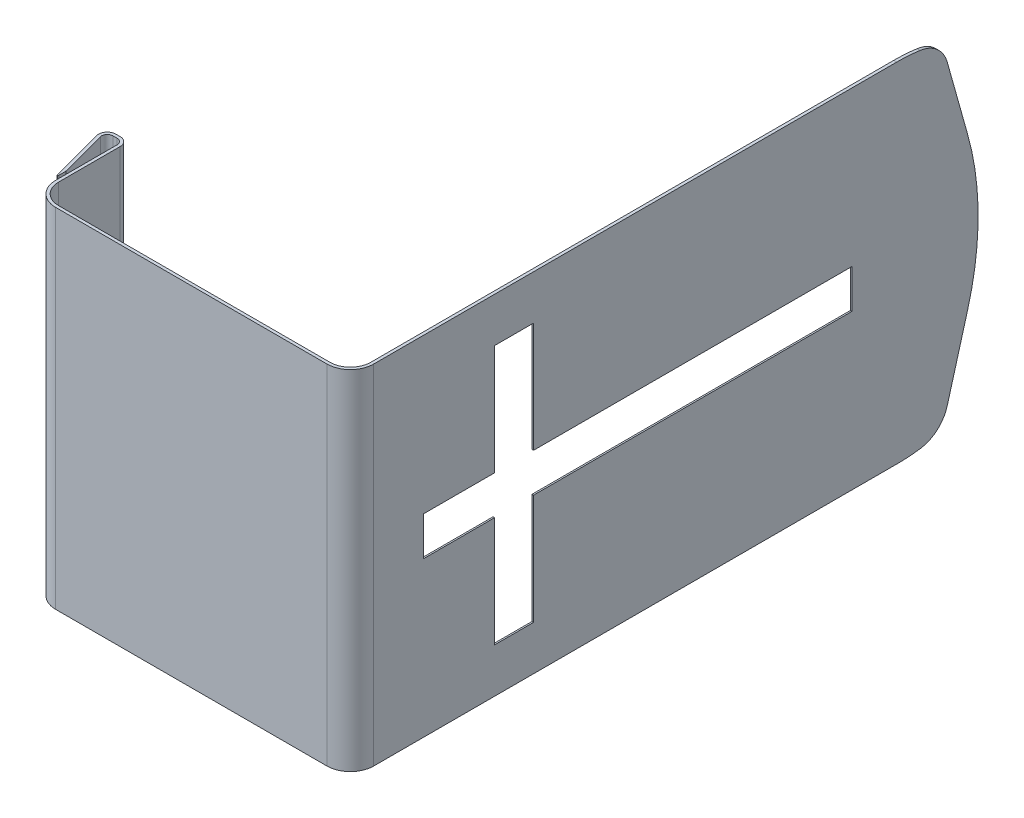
ISO-10303-21;
HEADER;
FILE_DESCRIPTION(('STEP AP214'),'2;1');
FILE_NAME('part.step','',(''),(''),'','','');
FILE_SCHEMA(('AUTOMOTIVE_DESIGN { 1 0 10303 214 1 1 1 1 }'));
ENDSEC;
DATA;
#1=APPLICATION_CONTEXT('core data for automotive mechanical design processes');
#2=APPLICATION_PROTOCOL_DEFINITION('international standard','automotive_design',2000,#1);
#3=PRODUCT_CONTEXT('',#1,'mechanical');
#4=PRODUCT('Part','Part','',(#3));
#5=PRODUCT_RELATED_PRODUCT_CATEGORY('part','',(#4));
#6=PRODUCT_DEFINITION_FORMATION('','',#4);
#7=PRODUCT_DEFINITION_CONTEXT('part definition',#1,'design');
#8=PRODUCT_DEFINITION('design','',#6,#7);
#9=PRODUCT_DEFINITION_SHAPE('','',#8);
#10=(LENGTH_UNIT() NAMED_UNIT(*) SI_UNIT(.MILLI.,.METRE.));
#11=(NAMED_UNIT(*) PLANE_ANGLE_UNIT() SI_UNIT($,.RADIAN.));
#12=(NAMED_UNIT(*) SI_UNIT($,.STERADIAN.) SOLID_ANGLE_UNIT());
#13=UNCERTAINTY_MEASURE_WITH_UNIT(LENGTH_MEASURE(1.E-05),#10,'distance_accuracy_value','');
#14=(GEOMETRIC_REPRESENTATION_CONTEXT(3) GLOBAL_UNCERTAINTY_ASSIGNED_CONTEXT((#13)) GLOBAL_UNIT_ASSIGNED_CONTEXT((#10,
#11,#12)) REPRESENTATION_CONTEXT('',''));
#15=CARTESIAN_POINT('',(0.,0.,0.));
#16=DIRECTION('',(0.,0.,1.));
#17=DIRECTION('',(1.,0.,0.));
#18=AXIS2_PLACEMENT_3D('',#15,#16,#17);
#19=CARTESIAN_POINT('',(3.175,0.,0.));
#20=DIRECTION('',(1.,0.,0.));
#21=DIRECTION('',(0.,0.,-1.));
#22=AXIS2_PLACEMENT_3D('',#19,#20,#21);
#23=PLANE('',#22);
#24=DIRECTION('',(0.,0.,1.));
#25=VECTOR('',#24,1.);
#26=CARTESIAN_POINT('',(3.175,186.063255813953,277.));
#27=LINE('',#26,#25);
#28=CARTESIAN_POINT('',(3.175,186.063255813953,-277.));
#29=VERTEX_POINT('',#28);
#30=CARTESIAN_POINT('',(3.175,186.063255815,282.));
#31=VERTEX_POINT('',#30);
#32=EDGE_CURVE('E696',#29,#31,#27,.T.);
#33=ORIENTED_EDGE('',*,*,#32,.T.);
#34=DIRECTION('',(0.,-1.,0.));
#35=VECTOR('',#34,1.);
#36=CARTESIAN_POINT('',(3.175,186.063255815,282.));
#37=LINE('',#36,#35);
#38=CARTESIAN_POINT('',(3.175,-186.063255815,282.));
#39=VERTEX_POINT('',#38);
#40=EDGE_CURVE('E466',#31,#39,#37,.T.);
#41=ORIENTED_EDGE('',*,*,#40,.T.);
#42=DIRECTION('',(0.,0.,-1.));
#43=VECTOR('',#42,1.);
#44=CARTESIAN_POINT('',(3.175,-186.063255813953,277.));
#45=LINE('',#44,#43);
#46=CARTESIAN_POINT('',(3.175,-186.063255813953,-277.));
#47=VERTEX_POINT('',#46);
#48=EDGE_CURVE('E380',#39,#47,#45,.T.);
#49=ORIENTED_EDGE('',*,*,#48,.T.);
#50=CARTESIAN_POINT('',(3.17499999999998,0.,-277.));
#51=DIRECTION('',(1.,0.,0.));
#52=DIRECTION('',(0.,0.,-1.));
#53=AXIS2_PLACEMENT_3D('',#50,#51,#52);
#54=CIRCLE('',#53,186.063255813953);
#55=CARTESIAN_POINT('',(3.17499999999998,-184.388589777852,-301.907491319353));
#56=VERTEX_POINT('',#55);
#57=EDGE_CURVE('E361',#47,#56,#54,.T.);
#58=ORIENTED_EDGE('',*,*,#57,.T.);
#59=CARTESIAN_POINT('',(3.17499999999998,-149.703607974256,-297.222191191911));
#60=DIRECTION('',(1.,0.,0.));
#61=DIRECTION('',(0.,0.,-1.));
#62=AXIS2_PLACEMENT_3D('',#59,#60,#61);
#63=CIRCLE('',#62,35.);
#64=CARTESIAN_POINT('',(3.17499999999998,-159.149882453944,-330.923346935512));
#65=VERTEX_POINT('',#64);
#66=EDGE_CURVE('E352',#56,#65,#63,.T.);
#67=ORIENTED_EDGE('',*,*,#66,.T.);
#68=DIRECTION('',(0.,0.962890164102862,-0.269893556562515));
#69=VECTOR('',#68,1.);
#70=CARTESIAN_POINT('',(3.17499999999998,-159.149882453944,-330.923346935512));
#71=LINE('',#70,#69);
#72=CARTESIAN_POINT('',(3.17499999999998,-80.9680669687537,-352.837339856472));
#73=VERTEX_POINT('',#72);
#74=EDGE_CURVE('E365',#65,#73,#71,.T.);
#75=ORIENTED_EDGE('',*,*,#74,.T.);
#76=CARTESIAN_POINT('',(3.17499999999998,7.93635990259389E-13,-63.9702906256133));
#77=DIRECTION('',(1.,0.,0.));
#78=DIRECTION('',(0.,0.,-1.));
#79=AXIS2_PLACEMENT_3D('',#76,#77,#78);
#80=CIRCLE('',#79,300.);
#81=CARTESIAN_POINT('',(3.17499999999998,80.9680669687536,-352.837339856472));
#82=VERTEX_POINT('',#81);
#83=EDGE_CURVE('E1360',#73,#82,#80,.T.);
#84=ORIENTED_EDGE('',*,*,#83,.T.);
#85=DIRECTION('',(0.,0.962890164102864,0.26989355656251));
#86=VECTOR('',#85,1.);
#87=CARTESIAN_POINT('',(3.17499999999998,80.9680669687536,-352.837339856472));
#88=LINE('',#87,#86);
#89=CARTESIAN_POINT('',(3.17499999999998,159.149882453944,-330.923346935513));
#90=VERTEX_POINT('',#89);
#91=EDGE_CURVE('E1355',#82,#90,#88,.T.);
#92=ORIENTED_EDGE('',*,*,#91,.T.);
#93=CARTESIAN_POINT('',(3.17499999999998,149.703607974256,-297.222191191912));
#94=DIRECTION('',(1.,0.,0.));
#95=DIRECTION('',(0.,0.,-1.));
#96=AXIS2_PLACEMENT_3D('',#93,#94,#95);
#97=CIRCLE('',#96,35.);
#98=CARTESIAN_POINT('',(3.17499999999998,184.388589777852,-301.907491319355));
#99=VERTEX_POINT('',#98);
#100=EDGE_CURVE('E1344',#90,#99,#97,.T.);
#101=ORIENTED_EDGE('',*,*,#100,.T.);
#102=CARTESIAN_POINT('',(3.17499999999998,0.,-277.));
#103=DIRECTION('',(1.,0.,0.));
#104=DIRECTION('',(0.,0.,-1.));
#105=AXIS2_PLACEMENT_3D('',#102,#103,#104);
#106=CIRCLE('',#105,186.063255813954);
#107=EDGE_CURVE('E475',#99,#29,#106,.T.);
#108=ORIENTED_EDGE('',*,*,#107,.T.);
#109=EDGE_LOOP('',(#33,#41,#49,#58,#67,#75,#84,#92,#101,#108));
#110=FACE_BOUND('',#109,.T.);
#111=DIRECTION('',(0.,-1.,0.));
#112=VECTOR('',#111,1.);
#113=CARTESIAN_POINT('',(3.175,-138.475,152.75));
#114=LINE('',#113,#112);
#115=CARTESIAN_POINT('',(3.175,-20.75,152.75));
#116=VERTEX_POINT('',#115);
#117=CARTESIAN_POINT('',(3.175,-138.475,152.75));
#118=VERTEX_POINT('',#117);
#119=EDGE_CURVE('E618',#116,#118,#114,.T.);
#120=ORIENTED_EDGE('',*,*,#119,.F.);
#121=DIRECTION('',(0.,0.,-1.));
#122=VECTOR('',#121,1.);
#123=CARTESIAN_POINT('',(3.175,-20.75,152.75));
#124=LINE('',#123,#122);
#125=CARTESIAN_POINT('',(3.175,-20.75,229.));
#126=VERTEX_POINT('',#125);
#127=EDGE_CURVE('E614',#126,#116,#124,.T.);
#128=ORIENTED_EDGE('',*,*,#127,.F.);
#129=DIRECTION('',(0.,-1.,0.));
#130=VECTOR('',#129,1.);
#131=CARTESIAN_POINT('',(3.175,-20.75,229.));
#132=LINE('',#131,#130);
#133=CARTESIAN_POINT('',(3.175,20.7499999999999,229.));
#134=VERTEX_POINT('',#133);
#135=EDGE_CURVE('E646',#134,#126,#132,.T.);
#136=ORIENTED_EDGE('',*,*,#135,.F.);
#137=DIRECTION('',(0.,0.,1.));
#138=VECTOR('',#137,1.);
#139=CARTESIAN_POINT('',(3.175,20.7499999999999,229.));
#140=LINE('',#139,#138);
#141=CARTESIAN_POINT('',(3.175,20.7499999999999,152.75));
#142=VERTEX_POINT('',#141);
#143=EDGE_CURVE('E644',#142,#134,#140,.T.);
#144=ORIENTED_EDGE('',*,*,#143,.F.);
#145=DIRECTION('',(0.,-1.,0.));
#146=VECTOR('',#145,1.);
#147=CARTESIAN_POINT('',(3.175,20.7499999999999,152.75));
#148=LINE('',#147,#146);
#149=CARTESIAN_POINT('',(3.175,138.525,152.75));
#150=VERTEX_POINT('',#149);
#151=EDGE_CURVE('E639',#150,#142,#148,.T.);
#152=ORIENTED_EDGE('',*,*,#151,.F.);
#153=DIRECTION('',(0.,0.,1.));
#154=VECTOR('',#153,1.);
#155=CARTESIAN_POINT('',(3.175,138.525,152.75));
#156=LINE('',#155,#154);
#157=CARTESIAN_POINT('',(3.175,138.525,111.25));
#158=VERTEX_POINT('',#157);
#159=EDGE_CURVE('E640',#158,#150,#156,.T.);
#160=ORIENTED_EDGE('',*,*,#159,.F.);
#161=DIRECTION('',(0.,1.,0.));
#162=VECTOR('',#161,1.);
#163=CARTESIAN_POINT('',(3.175,138.525,111.25));
#164=LINE('',#163,#162);
#165=CARTESIAN_POINT('',(3.175,20.7499999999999,111.25));
#166=VERTEX_POINT('',#165);
#167=EDGE_CURVE('E632',#166,#158,#164,.T.);
#168=ORIENTED_EDGE('',*,*,#167,.F.);
#169=DIRECTION('',(0.,0.,1.));
#170=VECTOR('',#169,1.);
#171=CARTESIAN_POINT('',(3.175,20.7499999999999,111.25));
#172=LINE('',#171,#170);
#173=CARTESIAN_POINT('',(3.175,20.75,-229.));
#174=VERTEX_POINT('',#173);
#175=EDGE_CURVE('E631',#174,#166,#172,.T.);
#176=ORIENTED_EDGE('',*,*,#175,.F.);
#177=DIRECTION('',(0.,1.,0.));
#178=VECTOR('',#177,1.);
#179=CARTESIAN_POINT('',(3.175,20.75,-229.));
#180=LINE('',#179,#178);
#181=CARTESIAN_POINT('',(3.175,-20.7500000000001,-229.));
#182=VERTEX_POINT('',#181);
#183=EDGE_CURVE('E628',#182,#174,#180,.T.);
#184=ORIENTED_EDGE('',*,*,#183,.F.);
#185=DIRECTION('',(0.,0.,-1.));
#186=VECTOR('',#185,1.);
#187=CARTESIAN_POINT('',(3.175,-20.7500000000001,-229.));
#188=LINE('',#187,#186);
#189=CARTESIAN_POINT('',(3.175,-20.75,111.25));
#190=VERTEX_POINT('',#189);
#191=EDGE_CURVE('E622',#190,#182,#188,.T.);
#192=ORIENTED_EDGE('',*,*,#191,.F.);
#193=DIRECTION('',(0.,1.,0.));
#194=VECTOR('',#193,1.);
#195=CARTESIAN_POINT('',(3.175,-20.75,111.25));
#196=LINE('',#195,#194);
#197=CARTESIAN_POINT('',(3.175,-138.475,111.25));
#198=VERTEX_POINT('',#197);
#199=EDGE_CURVE('E625',#198,#190,#196,.T.);
#200=ORIENTED_EDGE('',*,*,#199,.F.);
#201=DIRECTION('',(0.,0.,-1.));
#202=VECTOR('',#201,1.);
#203=CARTESIAN_POINT('',(3.175,-138.475,111.25));
#204=LINE('',#203,#202);
#205=EDGE_CURVE('E620',#118,#198,#204,.T.);
#206=ORIENTED_EDGE('',*,*,#205,.F.);
#207=EDGE_LOOP('',(#120,#128,#136,#144,#152,#160,#168,#176,#184,#192,#200,#206));
#208=FACE_BOUND('',#207,.T.);
#209=ADVANCED_FACE('F50',(#110,#208),#23,.T.);
#210=CARTESIAN_POINT('',(0.,0.,0.));
#211=DIRECTION('',(1.,0.,0.));
#212=DIRECTION('',(0.,0.,-1.));
#213=AXIS2_PLACEMENT_3D('',#210,#211,#212);
#214=PLANE('',#213);
#215=DIRECTION('',(0.,0.,-1.));
#216=VECTOR('',#215,1.);
#217=CARTESIAN_POINT('',(0.,-22.2740000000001,-229.));
#218=LINE('',#217,#216);
#219=CARTESIAN_POINT('',(0.,-22.2740000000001,109.726));
#220=VERTEX_POINT('',#219);
#221=CARTESIAN_POINT('',(0.,-22.2740000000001,-230.524));
#222=VERTEX_POINT('',#221);
#223=EDGE_CURVE('E721',#220,#222,#218,.T.);
#224=ORIENTED_EDGE('',*,*,#223,.T.);
#225=DIRECTION('',(0.,1.,0.));
#226=VECTOR('',#225,1.);
#227=CARTESIAN_POINT('',(0.,20.75,-230.524));
#228=LINE('',#227,#226);
#229=CARTESIAN_POINT('',(0.,22.274,-230.524));
#230=VERTEX_POINT('',#229);
#231=EDGE_CURVE('E743',#222,#230,#228,.T.);
#232=ORIENTED_EDGE('',*,*,#231,.T.);
#233=DIRECTION('',(0.,0.,1.));
#234=VECTOR('',#233,1.);
#235=CARTESIAN_POINT('',(0.,22.274,111.25));
#236=LINE('',#235,#234);
#237=CARTESIAN_POINT('',(0.,22.274,109.726));
#238=VERTEX_POINT('',#237);
#239=EDGE_CURVE('E745',#230,#238,#236,.T.);
#240=ORIENTED_EDGE('',*,*,#239,.T.);
#241=DIRECTION('',(0.,1.,0.));
#242=VECTOR('',#241,1.);
#243=CARTESIAN_POINT('',(0.,138.525,109.726));
#244=LINE('',#243,#242);
#245=CARTESIAN_POINT('',(0.,140.049,109.726));
#246=VERTEX_POINT('',#245);
#247=EDGE_CURVE('E738',#238,#246,#244,.T.);
#248=ORIENTED_EDGE('',*,*,#247,.T.);
#249=DIRECTION('',(0.,0.,1.));
#250=VECTOR('',#249,1.);
#251=CARTESIAN_POINT('',(0.,140.049,152.75));
#252=LINE('',#251,#250);
#253=CARTESIAN_POINT('',(0.,140.049,154.274));
#254=VERTEX_POINT('',#253);
#255=EDGE_CURVE('E736',#246,#254,#252,.T.);
#256=ORIENTED_EDGE('',*,*,#255,.T.);
#257=DIRECTION('',(0.,-1.,0.));
#258=VECTOR('',#257,1.);
#259=CARTESIAN_POINT('',(0.,20.7499999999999,154.274));
#260=LINE('',#259,#258);
#261=CARTESIAN_POINT('',(0.,22.274,154.274));
#262=VERTEX_POINT('',#261);
#263=EDGE_CURVE('E735',#254,#262,#260,.T.);
#264=ORIENTED_EDGE('',*,*,#263,.T.);
#265=DIRECTION('',(0.,0.,1.));
#266=VECTOR('',#265,1.);
#267=CARTESIAN_POINT('',(0.,22.274,229.));
#268=LINE('',#267,#266);
#269=CARTESIAN_POINT('',(0.,22.274,230.524));
#270=VERTEX_POINT('',#269);
#271=EDGE_CURVE('E728',#262,#270,#268,.T.);
#272=ORIENTED_EDGE('',*,*,#271,.T.);
#273=DIRECTION('',(0.,-1.,0.));
#274=VECTOR('',#273,1.);
#275=CARTESIAN_POINT('',(0.,-20.75,230.524));
#276=LINE('',#275,#274);
#277=CARTESIAN_POINT('',(0.,-22.2740000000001,230.524));
#278=VERTEX_POINT('',#277);
#279=EDGE_CURVE('E730',#270,#278,#276,.T.);
#280=ORIENTED_EDGE('',*,*,#279,.T.);
#281=DIRECTION('',(0.,0.,-1.));
#282=VECTOR('',#281,1.);
#283=CARTESIAN_POINT('',(0.,-22.2740000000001,152.75));
#284=LINE('',#283,#282);
#285=CARTESIAN_POINT('',(0.,-22.2740000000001,154.274));
#286=VERTEX_POINT('',#285);
#287=EDGE_CURVE('E711',#278,#286,#284,.T.);
#288=ORIENTED_EDGE('',*,*,#287,.T.);
#289=DIRECTION('',(0.,-1.,0.));
#290=VECTOR('',#289,1.);
#291=CARTESIAN_POINT('',(0.,-138.475,154.274));
#292=LINE('',#291,#290);
#293=CARTESIAN_POINT('',(0.,-139.999,154.274));
#294=VERTEX_POINT('',#293);
#295=EDGE_CURVE('E712',#286,#294,#292,.T.);
#296=ORIENTED_EDGE('',*,*,#295,.T.);
#297=DIRECTION('',(0.,0.,-1.));
#298=VECTOR('',#297,1.);
#299=CARTESIAN_POINT('',(0.,-139.999,111.25));
#300=LINE('',#299,#298);
#301=CARTESIAN_POINT('',(0.,-139.999,109.726));
#302=VERTEX_POINT('',#301);
#303=EDGE_CURVE('E717',#294,#302,#300,.T.);
#304=ORIENTED_EDGE('',*,*,#303,.T.);
#305=DIRECTION('',(0.,1.,0.));
#306=VECTOR('',#305,1.);
#307=CARTESIAN_POINT('',(0.,-20.75,109.726));
#308=LINE('',#307,#306);
#309=EDGE_CURVE('E722',#302,#220,#308,.T.);
#310=ORIENTED_EDGE('',*,*,#309,.T.);
#311=EDGE_LOOP('',(#224,#232,#240,#248,#256,#264,#272,#280,#288,#296,#304,#310));
#312=FACE_BOUND('',#311,.T.);
#313=DIRECTION('',(0.,0.,1.));
#314=VECTOR('',#313,1.);
#315=CARTESIAN_POINT('',(0.,186.063255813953,277.));
#316=LINE('',#315,#314);
#317=CARTESIAN_POINT('',(0.,186.063255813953,-277.));
#318=VERTEX_POINT('',#317);
#319=CARTESIAN_POINT('',(0.,186.063255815,282.));
#320=VERTEX_POINT('',#319);
#321=EDGE_CURVE('E694',#318,#320,#316,.T.);
#322=ORIENTED_EDGE('',*,*,#321,.F.);
#323=CARTESIAN_POINT('',(0.,0.,-277.));
#324=DIRECTION('',(1.,0.,0.));
#325=DIRECTION('',(0.,0.,-1.));
#326=AXIS2_PLACEMENT_3D('',#323,#324,#325);
#327=CIRCLE('',#326,186.063255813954);
#328=CARTESIAN_POINT('',(0.,184.388589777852,-301.907491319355));
#329=VERTEX_POINT('',#328);
#330=EDGE_CURVE('E379',#329,#318,#327,.T.);
#331=ORIENTED_EDGE('',*,*,#330,.F.);
#332=CARTESIAN_POINT('',(0.,149.703607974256,-297.222191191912));
#333=DIRECTION('',(1.,0.,0.));
#334=DIRECTION('',(0.,0.,1.));
#335=AXIS2_PLACEMENT_3D('',#332,#333,#334);
#336=CIRCLE('',#335,35.);
#337=CARTESIAN_POINT('',(0.,159.149882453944,-330.923346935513));
#338=VERTEX_POINT('',#337);
#339=EDGE_CURVE('E401',#338,#329,#336,.T.);
#340=ORIENTED_EDGE('',*,*,#339,.F.);
#341=DIRECTION('',(0.,0.962890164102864,0.26989355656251));
#342=VECTOR('',#341,1.);
#343=CARTESIAN_POINT('',(0.,80.9680669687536,-352.837339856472));
#344=LINE('',#343,#342);
#345=CARTESIAN_POINT('',(0.,80.9680669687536,-352.837339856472));
#346=VERTEX_POINT('',#345);
#347=EDGE_CURVE('E396',#346,#338,#344,.T.);
#348=ORIENTED_EDGE('',*,*,#347,.F.);
#349=CARTESIAN_POINT('',(0.,7.93635990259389E-13,-63.9702906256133));
#350=DIRECTION('',(1.,0.,0.));
#351=DIRECTION('',(0.,0.,-1.));
#352=AXIS2_PLACEMENT_3D('',#349,#350,#351);
#353=CIRCLE('',#352,300.);
#354=CARTESIAN_POINT('',(0.,-80.9680669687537,-352.837339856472));
#355=VERTEX_POINT('',#354);
#356=EDGE_CURVE('E394',#355,#346,#353,.T.);
#357=ORIENTED_EDGE('',*,*,#356,.F.);
#358=DIRECTION('',(0.,0.962890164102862,-0.269893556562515));
#359=VECTOR('',#358,1.);
#360=CARTESIAN_POINT('',(0.,-159.149882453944,-330.923346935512));
#361=LINE('',#360,#359);
#362=CARTESIAN_POINT('',(0.,-159.149882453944,-330.923346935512));
#363=VERTEX_POINT('',#362);
#364=EDGE_CURVE('E391',#363,#355,#361,.T.);
#365=ORIENTED_EDGE('',*,*,#364,.F.);
#366=CARTESIAN_POINT('',(0.,-149.703607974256,-297.222191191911));
#367=DIRECTION('',(1.,0.,0.));
#368=DIRECTION('',(0.,0.,1.));
#369=AXIS2_PLACEMENT_3D('',#366,#367,#368);
#370=CIRCLE('',#369,35.);
#371=CARTESIAN_POINT('',(0.,-184.388589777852,-301.907491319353));
#372=VERTEX_POINT('',#371);
#373=EDGE_CURVE('E373',#372,#363,#370,.T.);
#374=ORIENTED_EDGE('',*,*,#373,.F.);
#375=CARTESIAN_POINT('',(0.,0.,-277.));
#376=DIRECTION('',(1.,0.,0.));
#377=DIRECTION('',(0.,0.,-1.));
#378=AXIS2_PLACEMENT_3D('',#375,#376,#377);
#379=CIRCLE('',#378,186.063255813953);
#380=CARTESIAN_POINT('',(0.,-186.063255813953,-277.));
#381=VERTEX_POINT('',#380);
#382=EDGE_CURVE('E371',#381,#372,#379,.T.);
#383=ORIENTED_EDGE('',*,*,#382,.F.);
#384=DIRECTION('',(0.,0.,-1.));
#385=VECTOR('',#384,1.);
#386=CARTESIAN_POINT('',(0.,-186.063255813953,277.));
#387=LINE('',#386,#385);
#388=CARTESIAN_POINT('',(0.,-186.063255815,282.));
#389=VERTEX_POINT('',#388);
#390=EDGE_CURVE('E697',#389,#381,#387,.T.);
#391=ORIENTED_EDGE('',*,*,#390,.F.);
#392=DIRECTION('',(0.,-1.,0.));
#393=VECTOR('',#392,1.);
#394=CARTESIAN_POINT('',(0.,186.063255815,282.));
#395=LINE('',#394,#393);
#396=EDGE_CURVE('E607',#320,#389,#395,.T.);
#397=ORIENTED_EDGE('',*,*,#396,.F.);
#398=EDGE_LOOP('',(#322,#331,#340,#348,#357,#365,#374,#383,#391,#397));
#399=FACE_BOUND('',#398,.T.);
#400=ADVANCED_FACE('F875',(#312,#399),#214,.F.);
#401=CARTESIAN_POINT('',(3.175,186.063255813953,277.));
#402=DIRECTION('',(0.,-1.,0.));
#403=DIRECTION('',(0.,0.,-1.));
#404=AXIS2_PLACEMENT_3D('',#401,#402,#403);
#405=PLANE('',#404);
#406=ORIENTED_EDGE('',*,*,#321,.T.);
#407=CARTESIAN_POINT('',(-21.825,186.063255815,282.));
#408=DIRECTION('',(0.,-1.,0.));
#409=DIRECTION('',(0.,0.,-1.));
#410=AXIS2_PLACEMENT_3D('',#407,#408,#409);
#411=CIRCLE('',#410,21.825);
#412=CARTESIAN_POINT('',(-21.825,186.063255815,303.825));
#413=VERTEX_POINT('',#412);
#414=EDGE_CURVE('E409',#320,#413,#411,.T.);
#415=ORIENTED_EDGE('',*,*,#414,.T.);
#416=DIRECTION('',(-1.,0.,0.));
#417=VECTOR('',#416,1.);
#418=CARTESIAN_POINT('',(-21.825,186.063255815,303.825));
#419=LINE('',#418,#417);
#420=CARTESIAN_POINT('',(-311.825,186.063255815,303.825));
#421=VERTEX_POINT('',#420);
#422=EDGE_CURVE('E408',#413,#421,#419,.T.);
#423=ORIENTED_EDGE('',*,*,#422,.T.);
#424=CARTESIAN_POINT('',(-311.825,186.063255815,282.));
#425=DIRECTION('',(0.,-1.,0.));
#426=DIRECTION('',(0.,0.,-1.));
#427=AXIS2_PLACEMENT_3D('',#424,#425,#426);
#428=CIRCLE('',#427,21.825);
#429=CARTESIAN_POINT('',(-333.65,186.063255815,282.));
#430=VERTEX_POINT('',#429);
#431=EDGE_CURVE('E412',#421,#430,#428,.T.);
#432=ORIENTED_EDGE('',*,*,#431,.T.);
#433=DIRECTION('',(0.,0.,-1.));
#434=VECTOR('',#433,1.);
#435=CARTESIAN_POINT('',(-333.65,186.063255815,282.));
#436=LINE('',#435,#434);
#437=CARTESIAN_POINT('',(-333.65,186.063255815,216.175));
#438=VERTEX_POINT('',#437);
#439=EDGE_CURVE('E417',#430,#438,#436,.T.);
#440=ORIENTED_EDGE('',*,*,#439,.T.);
#441=CARTESIAN_POINT('',(-342.825,186.063255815,216.175));
#442=DIRECTION('',(0.,1.,0.));
#443=DIRECTION('',(0.,0.,1.));
#444=AXIS2_PLACEMENT_3D('',#441,#442,#443);
#445=CIRCLE('',#444,9.175);
#446=CARTESIAN_POINT('',(-342.825,186.063255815,207.));
#447=VERTEX_POINT('',#446);
#448=EDGE_CURVE('E416',#438,#447,#445,.T.);
#449=ORIENTED_EDGE('',*,*,#448,.T.);
#450=DIRECTION('',(-1.,0.,0.));
#451=VECTOR('',#450,1.);
#452=CARTESIAN_POINT('',(-342.825,186.063255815,207.));
#453=LINE('',#452,#451);
#454=CARTESIAN_POINT('',(-347.457699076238,186.063255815,207.));
#455=VERTEX_POINT('',#454);
#456=EDGE_CURVE('E422',#447,#455,#453,.T.);
#457=ORIENTED_EDGE('',*,*,#456,.T.);
#458=CARTESIAN_POINT('',(-347.457699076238,186.063255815,216.175));
#459=DIRECTION('',(0.,1.,0.));
#460=DIRECTION('',(0.,0.,1.));
#461=AXIS2_PLACEMENT_3D('',#458,#459,#460);
#462=CIRCLE('',#461,9.17500000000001);
#463=CARTESIAN_POINT('',(-356.32006853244,186.063255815,218.549664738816));
#464=VERTEX_POINT('',#463);
#465=EDGE_CURVE('E424',#455,#464,#462,.T.);
#466=ORIENTED_EDGE('',*,*,#465,.T.);
#467=DIRECTION('',(0.258819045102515,0.,0.96592582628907));
#468=VECTOR('',#467,1.);
#469=CARTESIAN_POINT('',(-356.32006853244,186.063255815,218.549664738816));
#470=LINE('',#469,#468);
#471=CARTESIAN_POINT('',(-340.790925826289,186.063255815,276.50521431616));
#472=VERTEX_POINT('',#471);
#473=EDGE_CURVE('E426',#464,#472,#470,.T.);
#474=ORIENTED_EDGE('',*,*,#473,.T.);
#475=DIRECTION('',(0.965925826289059,0.,-0.258819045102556));
#476=VECTOR('',#475,1.);
#477=CARTESIAN_POINT('',(-340.566180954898,186.063255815,276.444994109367));
#478=LINE('',#477,#476);
#479=CARTESIAN_POINT('',(-340.566180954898,186.063255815,276.444994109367));
#480=VERTEX_POINT('',#479);
#481=EDGE_CURVE('E431',#472,#480,#478,.T.);
#482=ORIENTED_EDGE('',*,*,#481,.T.);
#483=CARTESIAN_POINT('',(-340.825,186.063255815,275.479068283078));
#484=DIRECTION('',(0.,1.,0.));
#485=DIRECTION('',(0.,0.,-1.));
#486=AXIS2_PLACEMENT_3D('',#483,#484,#485);
#487=CIRCLE('',#486,0.999999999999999);
#488=CARTESIAN_POINT('',(-339.825,186.063255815,275.479068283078));
#489=VERTEX_POINT('',#488);
#490=EDGE_CURVE('E432',#480,#489,#487,.T.);
#491=ORIENTED_EDGE('',*,*,#490,.T.);
#492=DIRECTION('',(0.,0.,-1.));
#493=VECTOR('',#492,1.);
#494=CARTESIAN_POINT('',(-339.825,186.063255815,275.479068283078));
#495=LINE('',#494,#493);
#496=CARTESIAN_POINT('',(-339.825,186.063255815,267.974493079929));
#497=VERTEX_POINT('',#496);
#498=EDGE_CURVE('E440',#489,#497,#495,.T.);
#499=ORIENTED_EDGE('',*,*,#498,.T.);
#500=CARTESIAN_POINT('',(-340.825,186.063255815,267.974493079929));
#501=DIRECTION('',(0.,1.,0.));
#502=DIRECTION('',(0.,0.,-1.));
#503=AXIS2_PLACEMENT_3D('',#500,#501,#502);
#504=CIRCLE('',#503,0.999999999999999);
#505=CARTESIAN_POINT('',(-339.859074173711,186.063255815,267.715674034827));
#506=VERTEX_POINT('',#505);
#507=EDGE_CURVE('E439',#497,#506,#504,.T.);
#508=ORIENTED_EDGE('',*,*,#507,.T.);
#509=DIRECTION('',(-0.258819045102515,0.,-0.96592582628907));
#510=VECTOR('',#509,1.);
#511=CARTESIAN_POINT('',(-353.253254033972,186.063255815,217.727914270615));
#512=LINE('',#511,#510);
#513=CARTESIAN_POINT('',(-353.253254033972,186.063255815,217.727914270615));
#514=VERTEX_POINT('',#513);
#515=EDGE_CURVE('E442',#506,#514,#512,.T.);
#516=ORIENTED_EDGE('',*,*,#515,.T.);
#517=CARTESIAN_POINT('',(-347.457699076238,186.063255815,216.175));
#518=DIRECTION('',(0.,-1.,0.));
#519=DIRECTION('',(0.,0.,1.));
#520=AXIS2_PLACEMENT_3D('',#517,#518,#519);
#521=CIRCLE('',#520,5.99999999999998);
#522=CARTESIAN_POINT('',(-347.457699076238,186.063255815,210.175));
#523=VERTEX_POINT('',#522);
#524=EDGE_CURVE('E447',#514,#523,#521,.T.);
#525=ORIENTED_EDGE('',*,*,#524,.T.);
#526=DIRECTION('',(1.,0.,0.));
#527=VECTOR('',#526,1.);
#528=CARTESIAN_POINT('',(-342.825,186.063255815,210.175));
#529=LINE('',#528,#527);
#530=CARTESIAN_POINT('',(-342.825,186.063255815,210.175));
#531=VERTEX_POINT('',#530);
#532=EDGE_CURVE('E446',#523,#531,#529,.T.);
#533=ORIENTED_EDGE('',*,*,#532,.T.);
#534=CARTESIAN_POINT('',(-342.825,186.063255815,216.175));
#535=DIRECTION('',(0.,-1.,0.));
#536=DIRECTION('',(0.,0.,1.));
#537=AXIS2_PLACEMENT_3D('',#534,#535,#536);
#538=CIRCLE('',#537,6.00000000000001);
#539=CARTESIAN_POINT('',(-336.825,186.063255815,216.175));
#540=VERTEX_POINT('',#539);
#541=EDGE_CURVE('E451',#531,#540,#538,.T.);
#542=ORIENTED_EDGE('',*,*,#541,.T.);
#543=DIRECTION('',(0.,0.,1.));
#544=VECTOR('',#543,1.);
#545=CARTESIAN_POINT('',(-336.825,186.063255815,282.));
#546=LINE('',#545,#544);
#547=CARTESIAN_POINT('',(-336.825,186.063255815,282.));
#548=VERTEX_POINT('',#547);
#549=EDGE_CURVE('E452',#540,#548,#546,.T.);
#550=ORIENTED_EDGE('',*,*,#549,.T.);
#551=CARTESIAN_POINT('',(-311.825,186.063255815,282.));
#552=DIRECTION('',(0.,1.,0.));
#553=DIRECTION('',(0.,0.,-1.));
#554=AXIS2_PLACEMENT_3D('',#551,#552,#553);
#555=CIRCLE('',#554,25.);
#556=CARTESIAN_POINT('',(-311.825,186.063255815,307.));
#557=VERTEX_POINT('',#556);
#558=EDGE_CURVE('E457',#548,#557,#555,.T.);
#559=ORIENTED_EDGE('',*,*,#558,.T.);
#560=DIRECTION('',(1.,0.,0.));
#561=VECTOR('',#560,1.);
#562=CARTESIAN_POINT('',(-21.825,186.063255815,307.));
#563=LINE('',#562,#561);
#564=CARTESIAN_POINT('',(-21.825,186.063255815,307.));
#565=VERTEX_POINT('',#564);
#566=EDGE_CURVE('E462',#557,#565,#563,.T.);
#567=ORIENTED_EDGE('',*,*,#566,.T.);
#568=CARTESIAN_POINT('',(-21.825,186.063255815,282.));
#569=DIRECTION('',(0.,1.,0.));
#570=DIRECTION('',(0.,0.,-1.));
#571=AXIS2_PLACEMENT_3D('',#568,#569,#570);
#572=CIRCLE('',#571,25.);
#573=EDGE_CURVE('E461',#565,#31,#572,.T.);
#574=ORIENTED_EDGE('',*,*,#573,.T.);
#575=ORIENTED_EDGE('',*,*,#32,.F.);
#576=DIRECTION('',(-1.,0.,0.));
#577=VECTOR('',#576,1.);
#578=CARTESIAN_POINT('',(3.175,186.063255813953,-277.));
#579=LINE('',#578,#577);
#580=EDGE_CURVE('E705',#29,#318,#579,.T.);
#581=ORIENTED_EDGE('',*,*,#580,.T.);
#582=EDGE_LOOP('',(#406,#415,#423,#432,#440,#449,#457,#466,#474,#482,#491,#499,#508,#516,#525,
#533,#542,#550,#559,#567,#574,#575,#581));
#583=FACE_BOUND('',#582,.T.);
#584=ADVANCED_FACE('F902',(#583),#405,.F.);
#585=CARTESIAN_POINT('',(3.175,-186.063255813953,277.));
#586=DIRECTION('',(0.,1.,0.));
#587=DIRECTION('',(0.,0.,1.));
#588=AXIS2_PLACEMENT_3D('',#585,#586,#587);
#589=PLANE('',#588);
#590=ORIENTED_EDGE('',*,*,#390,.T.);
#591=DIRECTION('',(-1.,0.,0.));
#592=VECTOR('',#591,1.);
#593=CARTESIAN_POINT('',(3.175,-186.063255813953,-277.));
#594=LINE('',#593,#592);
#595=EDGE_CURVE('E706',#47,#381,#594,.T.);
#596=ORIENTED_EDGE('',*,*,#595,.F.);
#597=ORIENTED_EDGE('',*,*,#48,.F.);
#598=CARTESIAN_POINT('',(-21.825,-186.063255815,282.));
#599=DIRECTION('',(0.,1.,0.));
#600=DIRECTION('',(0.,0.,-1.));
#601=AXIS2_PLACEMENT_3D('',#598,#599,#600);
#602=CIRCLE('',#601,25.);
#603=CARTESIAN_POINT('',(-21.825,-186.063255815,307.));
#604=VERTEX_POINT('',#603);
#605=EDGE_CURVE('E407',#604,#39,#602,.T.);
#606=ORIENTED_EDGE('',*,*,#605,.F.);
#607=DIRECTION('',(1.,0.,0.));
#608=VECTOR('',#607,1.);
#609=CARTESIAN_POINT('',(-21.825,-186.063255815,307.));
#610=LINE('',#609,#608);
#611=CARTESIAN_POINT('',(-311.825,-186.063255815,307.));
#612=VERTEX_POINT('',#611);
#613=EDGE_CURVE('E523',#612,#604,#610,.T.);
#614=ORIENTED_EDGE('',*,*,#613,.F.);
#615=CARTESIAN_POINT('',(-311.825,-186.063255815,282.));
#616=DIRECTION('',(0.,1.,0.));
#617=DIRECTION('',(0.,0.,-1.));
#618=AXIS2_PLACEMENT_3D('',#615,#616,#617);
#619=CIRCLE('',#618,25.);
#620=CARTESIAN_POINT('',(-336.825,-186.063255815,282.));
#621=VERTEX_POINT('',#620);
#622=EDGE_CURVE('E521',#621,#612,#619,.T.);
#623=ORIENTED_EDGE('',*,*,#622,.F.);
#624=DIRECTION('',(0.,0.,1.));
#625=VECTOR('',#624,1.);
#626=CARTESIAN_POINT('',(-336.825,-186.063255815,282.));
#627=LINE('',#626,#625);
#628=CARTESIAN_POINT('',(-336.825,-186.063255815,216.175));
#629=VERTEX_POINT('',#628);
#630=EDGE_CURVE('E520',#629,#621,#627,.T.);
#631=ORIENTED_EDGE('',*,*,#630,.F.);
#632=CARTESIAN_POINT('',(-342.825,-186.063255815,216.175));
#633=DIRECTION('',(0.,-1.,0.));
#634=DIRECTION('',(0.,0.,1.));
#635=AXIS2_PLACEMENT_3D('',#632,#633,#634);
#636=CIRCLE('',#635,6.00000000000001);
#637=CARTESIAN_POINT('',(-342.825,-186.063255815,210.175));
#638=VERTEX_POINT('',#637);
#639=EDGE_CURVE('E513',#638,#629,#636,.T.);
#640=ORIENTED_EDGE('',*,*,#639,.F.);
#641=DIRECTION('',(1.,0.,0.));
#642=VECTOR('',#641,1.);
#643=CARTESIAN_POINT('',(-342.825,-186.063255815,210.175));
#644=LINE('',#643,#642);
#645=CARTESIAN_POINT('',(-347.457699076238,-186.063255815,210.175));
#646=VERTEX_POINT('',#645);
#647=EDGE_CURVE('E515',#646,#638,#644,.T.);
#648=ORIENTED_EDGE('',*,*,#647,.F.);
#649=CARTESIAN_POINT('',(-347.457699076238,-186.063255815,216.175));
#650=DIRECTION('',(0.,-1.,0.));
#651=DIRECTION('',(0.,0.,1.));
#652=AXIS2_PLACEMENT_3D('',#649,#650,#651);
#653=CIRCLE('',#652,5.99999999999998);
#654=CARTESIAN_POINT('',(-353.253254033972,-186.063255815,217.727914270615));
#655=VERTEX_POINT('',#654);
#656=EDGE_CURVE('E508',#655,#646,#653,.T.);
#657=ORIENTED_EDGE('',*,*,#656,.F.);
#658=DIRECTION('',(-0.258819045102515,0.,-0.96592582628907));
#659=VECTOR('',#658,1.);
#660=CARTESIAN_POINT('',(-353.253254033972,-186.063255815,217.727914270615));
#661=LINE('',#660,#659);
#662=CARTESIAN_POINT('',(-339.859074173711,-186.063255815,267.715674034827));
#663=VERTEX_POINT('',#662);
#664=EDGE_CURVE('E506',#663,#655,#661,.T.);
#665=ORIENTED_EDGE('',*,*,#664,.F.);
#666=CARTESIAN_POINT('',(-340.825,-186.063255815,267.974493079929));
#667=DIRECTION('',(0.,1.,0.));
#668=DIRECTION('',(0.,0.,-1.));
#669=AXIS2_PLACEMENT_3D('',#666,#667,#668);
#670=CIRCLE('',#669,0.999999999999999);
#671=CARTESIAN_POINT('',(-339.825,-186.063255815,267.974493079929));
#672=VERTEX_POINT('',#671);
#673=EDGE_CURVE('E503',#672,#663,#670,.T.);
#674=ORIENTED_EDGE('',*,*,#673,.F.);
#675=DIRECTION('',(0.,0.,-1.));
#676=VECTOR('',#675,1.);
#677=CARTESIAN_POINT('',(-339.825,-186.063255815,275.479068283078));
#678=LINE('',#677,#676);
#679=CARTESIAN_POINT('',(-339.825,-186.063255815,275.479068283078));
#680=VERTEX_POINT('',#679);
#681=EDGE_CURVE('E499',#680,#672,#678,.T.);
#682=ORIENTED_EDGE('',*,*,#681,.F.);
#683=CARTESIAN_POINT('',(-340.825,-186.063255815,275.479068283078));
#684=DIRECTION('',(0.,1.,0.));
#685=DIRECTION('',(0.,0.,-1.));
#686=AXIS2_PLACEMENT_3D('',#683,#684,#685);
#687=CIRCLE('',#686,0.999999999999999);
#688=CARTESIAN_POINT('',(-340.566180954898,-186.063255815,276.444994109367));
#689=VERTEX_POINT('',#688);
#690=EDGE_CURVE('E500',#689,#680,#687,.T.);
#691=ORIENTED_EDGE('',*,*,#690,.F.);
#692=DIRECTION('',(0.965925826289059,0.,-0.258819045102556));
#693=VECTOR('',#692,1.);
#694=CARTESIAN_POINT('',(-340.566180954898,-186.063255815,276.444994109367));
#695=LINE('',#694,#693);
#696=CARTESIAN_POINT('',(-340.790925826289,-186.063255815,276.50521431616));
#697=VERTEX_POINT('',#696);
#698=EDGE_CURVE('E494',#697,#689,#695,.T.);
#699=ORIENTED_EDGE('',*,*,#698,.F.);
#700=DIRECTION('',(0.258819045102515,0.,0.96592582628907));
#701=VECTOR('',#700,1.);
#702=CARTESIAN_POINT('',(-356.32006853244,-186.063255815,218.549664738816));
#703=LINE('',#702,#701);
#704=CARTESIAN_POINT('',(-356.32006853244,-186.063255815,218.549664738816));
#705=VERTEX_POINT('',#704);
#706=EDGE_CURVE('E493',#705,#697,#703,.T.);
#707=ORIENTED_EDGE('',*,*,#706,.F.);
#708=CARTESIAN_POINT('',(-347.457699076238,-186.063255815,216.175));
#709=DIRECTION('',(0.,1.,0.));
#710=DIRECTION('',(0.,0.,1.));
#711=AXIS2_PLACEMENT_3D('',#708,#709,#710);
#712=CIRCLE('',#711,9.17500000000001);
#713=CARTESIAN_POINT('',(-347.457699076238,-186.063255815,207.));
#714=VERTEX_POINT('',#713);
#715=EDGE_CURVE('E486',#714,#705,#712,.T.);
#716=ORIENTED_EDGE('',*,*,#715,.F.);
#717=DIRECTION('',(-1.,0.,0.));
#718=VECTOR('',#717,1.);
#719=CARTESIAN_POINT('',(-342.825,-186.063255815,207.));
#720=LINE('',#719,#718);
#721=CARTESIAN_POINT('',(-342.825,-186.063255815,207.));
#722=VERTEX_POINT('',#721);
#723=EDGE_CURVE('E483',#722,#714,#720,.T.);
#724=ORIENTED_EDGE('',*,*,#723,.F.);
#725=CARTESIAN_POINT('',(-342.825,-186.063255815,216.175));
#726=DIRECTION('',(0.,1.,0.));
#727=DIRECTION('',(0.,0.,1.));
#728=AXIS2_PLACEMENT_3D('',#725,#726,#727);
#729=CIRCLE('',#728,9.175);
#730=CARTESIAN_POINT('',(-333.65,-186.063255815,216.175));
#731=VERTEX_POINT('',#730);
#732=EDGE_CURVE('E485',#731,#722,#729,.T.);
#733=ORIENTED_EDGE('',*,*,#732,.F.);
#734=DIRECTION('',(0.,0.,-1.));
#735=VECTOR('',#734,1.);
#736=CARTESIAN_POINT('',(-333.65,-186.063255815,282.));
#737=LINE('',#736,#735);
#738=CARTESIAN_POINT('',(-333.65,-186.063255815,282.));
#739=VERTEX_POINT('',#738);
#740=EDGE_CURVE('E478',#739,#731,#737,.T.);
#741=ORIENTED_EDGE('',*,*,#740,.F.);
#742=CARTESIAN_POINT('',(-311.825,-186.063255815,282.));
#743=DIRECTION('',(0.,-1.,0.));
#744=DIRECTION('',(0.,0.,-1.));
#745=AXIS2_PLACEMENT_3D('',#742,#743,#744);
#746=CIRCLE('',#745,21.825);
#747=CARTESIAN_POINT('',(-311.825,-186.063255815,303.825));
#748=VERTEX_POINT('',#747);
#749=EDGE_CURVE('E476',#748,#739,#746,.T.);
#750=ORIENTED_EDGE('',*,*,#749,.F.);
#751=DIRECTION('',(-1.,0.,0.));
#752=VECTOR('',#751,1.);
#753=CARTESIAN_POINT('',(-21.825,-186.063255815,303.825));
#754=LINE('',#753,#752);
#755=CARTESIAN_POINT('',(-21.825,-186.063255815,303.825));
#756=VERTEX_POINT('',#755);
#757=EDGE_CURVE('E471',#756,#748,#754,.T.);
#758=ORIENTED_EDGE('',*,*,#757,.F.);
#759=CARTESIAN_POINT('',(-21.825,-186.063255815,282.));
#760=DIRECTION('',(0.,-1.,0.));
#761=DIRECTION('',(0.,0.,-1.));
#762=AXIS2_PLACEMENT_3D('',#759,#760,#761);
#763=CIRCLE('',#762,21.825);
#764=EDGE_CURVE('E469',#389,#756,#763,.T.);
#765=ORIENTED_EDGE('',*,*,#764,.F.);
#766=EDGE_LOOP('',(#590,#596,#597,#606,#614,#623,#631,#640,#648,#657,#665,#674,#682,#691,#699,
#707,#716,#724,#733,#741,#750,#758,#765));
#767=FACE_BOUND('',#766,.T.);
#768=ADVANCED_FACE('F909',(#767),#589,.F.);
#769=CARTESIAN_POINT('',(3.175,-20.75,152.75));
#770=DIRECTION('',(0.,1.,0.));
#771=DIRECTION('',(0.,0.,1.));
#772=AXIS2_PLACEMENT_3D('',#769,#770,#771);
#773=PLANE('',#772);
#774=DIRECTION('',(-1.,0.,0.));
#775=VECTOR('',#774,1.);
#776=CARTESIAN_POINT('',(3.175,-20.75,152.75));
#777=LINE('',#776,#775);
#778=CARTESIAN_POINT('',(1.52400000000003,-20.75,152.75));
#779=VERTEX_POINT('',#778);
#780=EDGE_CURVE('E695',#116,#779,#777,.T.);
#781=ORIENTED_EDGE('',*,*,#780,.T.);
#782=DIRECTION('',(0.,0.,1.));
#783=VECTOR('',#782,1.);
#784=CARTESIAN_POINT('',(1.52400000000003,-20.75,229.));
#785=LINE('',#784,#783);
#786=CARTESIAN_POINT('',(1.52400000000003,-20.75,229.));
#787=VERTEX_POINT('',#786);
#788=EDGE_CURVE('E11',#779,#787,#785,.T.);
#789=ORIENTED_EDGE('',*,*,#788,.T.);
#790=DIRECTION('',(-1.,0.,0.));
#791=VECTOR('',#790,1.);
#792=CARTESIAN_POINT('',(3.175,-20.75,229.));
#793=LINE('',#792,#791);
#794=EDGE_CURVE('E647',#126,#787,#793,.T.);
#795=ORIENTED_EDGE('',*,*,#794,.F.);
#796=ORIENTED_EDGE('',*,*,#127,.T.);
#797=EDGE_LOOP('',(#781,#789,#795,#796));
#798=FACE_BOUND('',#797,.T.);
#799=ADVANCED_FACE('F848',(#798),#773,.T.);
#800=CARTESIAN_POINT('',(3.175,-138.475,152.75));
#801=DIRECTION('',(0.,0.,-1.));
#802=DIRECTION('',(0.,1.,0.));
#803=AXIS2_PLACEMENT_3D('',#800,#801,#802);
#804=PLANE('',#803);
#805=DIRECTION('',(-1.,0.,0.));
#806=VECTOR('',#805,1.);
#807=CARTESIAN_POINT('',(3.175,-138.475,152.75));
#808=LINE('',#807,#806);
#809=CARTESIAN_POINT('',(1.52400000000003,-138.475,152.75));
#810=VERTEX_POINT('',#809);
#811=EDGE_CURVE('E689',#118,#810,#808,.T.);
#812=ORIENTED_EDGE('',*,*,#811,.T.);
#813=DIRECTION('',(0.,1.,0.));
#814=VECTOR('',#813,1.);
#815=CARTESIAN_POINT('',(1.52400000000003,-20.75,152.75));
#816=LINE('',#815,#814);
#817=EDGE_CURVE('E59',#810,#779,#816,.T.);
#818=ORIENTED_EDGE('',*,*,#817,.T.);
#819=ORIENTED_EDGE('',*,*,#780,.F.);
#820=ORIENTED_EDGE('',*,*,#119,.T.);
#821=EDGE_LOOP('',(#812,#818,#819,#820));
#822=FACE_BOUND('',#821,.T.);
#823=ADVANCED_FACE('F849',(#822),#804,.T.);
#824=CARTESIAN_POINT('',(3.175,-138.475,111.25));
#825=DIRECTION('',(0.,1.,0.));
#826=DIRECTION('',(0.,0.,1.));
#827=AXIS2_PLACEMENT_3D('',#824,#825,#826);
#828=PLANE('',#827);
#829=DIRECTION('',(-1.,0.,0.));
#830=VECTOR('',#829,1.);
#831=CARTESIAN_POINT('',(3.175,-138.475,111.25));
#832=LINE('',#831,#830);
#833=CARTESIAN_POINT('',(1.52400000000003,-138.475,111.25));
#834=VERTEX_POINT('',#833);
#835=EDGE_CURVE('E688',#198,#834,#832,.T.);
#836=ORIENTED_EDGE('',*,*,#835,.T.);
#837=DIRECTION('',(0.,0.,1.));
#838=VECTOR('',#837,1.);
#839=CARTESIAN_POINT('',(1.52400000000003,-138.475,152.75));
#840=LINE('',#839,#838);
#841=EDGE_CURVE('E74',#834,#810,#840,.T.);
#842=ORIENTED_EDGE('',*,*,#841,.T.);
#843=ORIENTED_EDGE('',*,*,#811,.F.);
#844=ORIENTED_EDGE('',*,*,#205,.T.);
#845=EDGE_LOOP('',(#836,#842,#843,#844));
#846=FACE_BOUND('',#845,.T.);
#847=ADVANCED_FACE('F853',(#846),#828,.T.);
#848=CARTESIAN_POINT('',(3.175,-20.75,111.25));
#849=DIRECTION('',(0.,0.,1.));
#850=DIRECTION('',(0.,-1.,0.));
#851=AXIS2_PLACEMENT_3D('',#848,#849,#850);
#852=PLANE('',#851);
#853=DIRECTION('',(-1.,0.,0.));
#854=VECTOR('',#853,1.);
#855=CARTESIAN_POINT('',(3.175,-20.75,111.25));
#856=LINE('',#855,#854);
#857=CARTESIAN_POINT('',(1.52400000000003,-20.75,111.25));
#858=VERTEX_POINT('',#857);
#859=EDGE_CURVE('E682',#190,#858,#856,.T.);
#860=ORIENTED_EDGE('',*,*,#859,.T.);
#861=DIRECTION('',(0.,-1.,0.));
#862=VECTOR('',#861,1.);
#863=CARTESIAN_POINT('',(1.52400000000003,-138.475,111.25));
#864=LINE('',#863,#862);
#865=EDGE_CURVE('E771',#858,#834,#864,.T.);
#866=ORIENTED_EDGE('',*,*,#865,.T.);
#867=ORIENTED_EDGE('',*,*,#835,.F.);
#868=ORIENTED_EDGE('',*,*,#199,.T.);
#869=EDGE_LOOP('',(#860,#866,#867,#868));
#870=FACE_BOUND('',#869,.T.);
#871=ADVANCED_FACE('F860',(#870),#852,.T.);
#872=CARTESIAN_POINT('',(3.175,-20.7500000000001,-229.));
#873=DIRECTION('',(0.,1.,0.));
#874=DIRECTION('',(0.,0.,1.));
#875=AXIS2_PLACEMENT_3D('',#872,#873,#874);
#876=PLANE('',#875);
#877=DIRECTION('',(-1.,0.,0.));
#878=VECTOR('',#877,1.);
#879=CARTESIAN_POINT('',(3.175,-20.7500000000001,-229.));
#880=LINE('',#879,#878);
#881=CARTESIAN_POINT('',(1.52400000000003,-20.7500000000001,-229.));
#882=VERTEX_POINT('',#881);
#883=EDGE_CURVE('E679',#182,#882,#880,.T.);
#884=ORIENTED_EDGE('',*,*,#883,.T.);
#885=DIRECTION('',(0.,0.,1.));
#886=VECTOR('',#885,1.);
#887=CARTESIAN_POINT('',(1.52400000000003,-20.75,111.25));
#888=LINE('',#887,#886);
#889=EDGE_CURVE('E772',#882,#858,#888,.T.);
#890=ORIENTED_EDGE('',*,*,#889,.T.);
#891=ORIENTED_EDGE('',*,*,#859,.F.);
#892=ORIENTED_EDGE('',*,*,#191,.T.);
#893=EDGE_LOOP('',(#884,#890,#891,#892));
#894=FACE_BOUND('',#893,.T.);
#895=ADVANCED_FACE('F1008',(#894),#876,.T.);
#896=CARTESIAN_POINT('',(3.175,20.75,-229.));
#897=DIRECTION('',(0.,0.,1.));
#898=DIRECTION('',(1.,0.,0.));
#899=AXIS2_PLACEMENT_3D('',#896,#897,#898);
#900=PLANE('',#899);
#901=DIRECTION('',(-1.,0.,0.));
#902=VECTOR('',#901,1.);
#903=CARTESIAN_POINT('',(3.175,20.75,-229.));
#904=LINE('',#903,#902);
#905=CARTESIAN_POINT('',(1.52400000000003,20.75,-229.));
#906=VERTEX_POINT('',#905);
#907=EDGE_CURVE('E673',#174,#906,#904,.T.);
#908=ORIENTED_EDGE('',*,*,#907,.T.);
#909=DIRECTION('',(0.,-1.,0.));
#910=VECTOR('',#909,1.);
#911=CARTESIAN_POINT('',(1.52400000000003,-20.7500000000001,-229.));
#912=LINE('',#911,#910);
#913=EDGE_CURVE('E750',#906,#882,#912,.T.);
#914=ORIENTED_EDGE('',*,*,#913,.T.);
#915=ORIENTED_EDGE('',*,*,#883,.F.);
#916=ORIENTED_EDGE('',*,*,#183,.T.);
#917=EDGE_LOOP('',(#908,#914,#915,#916));
#918=FACE_BOUND('',#917,.T.);
#919=ADVANCED_FACE('F1005',(#918),#900,.T.);
#920=CARTESIAN_POINT('',(3.175,20.7499999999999,111.25));
#921=DIRECTION('',(0.,-1.,0.));
#922=DIRECTION('',(0.,0.,-1.));
#923=AXIS2_PLACEMENT_3D('',#920,#921,#922);
#924=PLANE('',#923);
#925=DIRECTION('',(-1.,0.,0.));
#926=VECTOR('',#925,1.);
#927=CARTESIAN_POINT('',(3.175,20.7499999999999,111.25));
#928=LINE('',#927,#926);
#929=CARTESIAN_POINT('',(1.52400000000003,20.7499999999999,111.25));
#930=VERTEX_POINT('',#929);
#931=EDGE_CURVE('E667',#166,#930,#928,.T.);
#932=ORIENTED_EDGE('',*,*,#931,.T.);
#933=DIRECTION('',(0.,0.,-1.));
#934=VECTOR('',#933,1.);
#935=CARTESIAN_POINT('',(1.52400000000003,20.75,-229.));
#936=LINE('',#935,#934);
#937=EDGE_CURVE('E751',#930,#906,#936,.T.);
#938=ORIENTED_EDGE('',*,*,#937,.T.);
#939=ORIENTED_EDGE('',*,*,#907,.F.);
#940=ORIENTED_EDGE('',*,*,#175,.T.);
#941=EDGE_LOOP('',(#932,#938,#939,#940));
#942=FACE_BOUND('',#941,.T.);
#943=ADVANCED_FACE('F997',(#942),#924,.T.);
#944=CARTESIAN_POINT('',(3.175,138.525,111.25));
#945=DIRECTION('',(0.,0.,1.));
#946=DIRECTION('',(0.,-1.,0.));
#947=AXIS2_PLACEMENT_3D('',#944,#945,#946);
#948=PLANE('',#947);
#949=DIRECTION('',(-1.,0.,0.));
#950=VECTOR('',#949,1.);
#951=CARTESIAN_POINT('',(3.175,138.525,111.25));
#952=LINE('',#951,#950);
#953=CARTESIAN_POINT('',(1.52400000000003,138.525,111.25));
#954=VERTEX_POINT('',#953);
#955=EDGE_CURVE('E669',#158,#954,#952,.T.);
#956=ORIENTED_EDGE('',*,*,#955,.T.);
#957=DIRECTION('',(0.,-1.,0.));
#958=VECTOR('',#957,1.);
#959=CARTESIAN_POINT('',(1.52400000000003,20.7499999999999,111.25));
#960=LINE('',#959,#958);
#961=EDGE_CURVE('E756',#954,#930,#960,.T.);
#962=ORIENTED_EDGE('',*,*,#961,.T.);
#963=ORIENTED_EDGE('',*,*,#931,.F.);
#964=ORIENTED_EDGE('',*,*,#167,.T.);
#965=EDGE_LOOP('',(#956,#962,#963,#964));
#966=FACE_BOUND('',#965,.T.);
#967=ADVANCED_FACE('F993',(#966),#948,.T.);
#968=CARTESIAN_POINT('',(3.175,138.525,152.75));
#969=DIRECTION('',(0.,-1.,0.));
#970=DIRECTION('',(0.,0.,-1.));
#971=AXIS2_PLACEMENT_3D('',#968,#969,#970);
#972=PLANE('',#971);
#973=DIRECTION('',(-1.,0.,0.));
#974=VECTOR('',#973,1.);
#975=CARTESIAN_POINT('',(3.175,138.525,152.75));
#976=LINE('',#975,#974);
#977=CARTESIAN_POINT('',(1.52400000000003,138.525,152.75));
#978=VERTEX_POINT('',#977);
#979=EDGE_CURVE('E665',#150,#978,#976,.T.);
#980=ORIENTED_EDGE('',*,*,#979,.T.);
#981=DIRECTION('',(0.,0.,-1.));
#982=VECTOR('',#981,1.);
#983=CARTESIAN_POINT('',(1.52400000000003,138.525,111.25));
#984=LINE('',#983,#982);
#985=EDGE_CURVE('E757',#978,#954,#984,.T.);
#986=ORIENTED_EDGE('',*,*,#985,.T.);
#987=ORIENTED_EDGE('',*,*,#955,.F.);
#988=ORIENTED_EDGE('',*,*,#159,.T.);
#989=EDGE_LOOP('',(#980,#986,#987,#988));
#990=FACE_BOUND('',#989,.T.);
#991=ADVANCED_FACE('F988',(#990),#972,.T.);
#992=CARTESIAN_POINT('',(3.175,20.7499999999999,152.75));
#993=DIRECTION('',(0.,0.,-1.));
#994=DIRECTION('',(0.,1.,0.));
#995=AXIS2_PLACEMENT_3D('',#992,#993,#994);
#996=PLANE('',#995);
#997=DIRECTION('',(-1.,0.,0.));
#998=VECTOR('',#997,1.);
#999=CARTESIAN_POINT('',(3.175,20.7499999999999,152.75));
#1000=LINE('',#999,#998);
#1001=CARTESIAN_POINT('',(1.52400000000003,20.7499999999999,152.75));
#1002=VERTEX_POINT('',#1001);
#1003=EDGE_CURVE('E659',#142,#1002,#1000,.T.);
#1004=ORIENTED_EDGE('',*,*,#1003,.T.);
#1005=DIRECTION('',(0.,1.,0.));
#1006=VECTOR('',#1005,1.);
#1007=CARTESIAN_POINT('',(1.52400000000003,138.525,152.75));
#1008=LINE('',#1007,#1006);
#1009=EDGE_CURVE('E765',#1002,#978,#1008,.T.);
#1010=ORIENTED_EDGE('',*,*,#1009,.T.);
#1011=ORIENTED_EDGE('',*,*,#979,.F.);
#1012=ORIENTED_EDGE('',*,*,#151,.T.);
#1013=EDGE_LOOP('',(#1004,#1010,#1011,#1012));
#1014=FACE_BOUND('',#1013,.T.);
#1015=ADVANCED_FACE('F984',(#1014),#996,.T.);
#1016=CARTESIAN_POINT('',(3.175,20.7499999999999,229.));
#1017=DIRECTION('',(0.,-1.,0.));
#1018=DIRECTION('',(0.,0.,-1.));
#1019=AXIS2_PLACEMENT_3D('',#1016,#1017,#1018);
#1020=PLANE('',#1019);
#1021=DIRECTION('',(-1.,0.,0.));
#1022=VECTOR('',#1021,1.);
#1023=CARTESIAN_POINT('',(3.175,20.7499999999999,229.));
#1024=LINE('',#1023,#1022);
#1025=CARTESIAN_POINT('',(1.52400000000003,20.7499999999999,229.));
#1026=VERTEX_POINT('',#1025);
#1027=EDGE_CURVE('E653',#134,#1026,#1024,.T.);
#1028=ORIENTED_EDGE('',*,*,#1027,.T.);
#1029=DIRECTION('',(0.,0.,-1.));
#1030=VECTOR('',#1029,1.);
#1031=CARTESIAN_POINT('',(1.52400000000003,20.7499999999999,152.75));
#1032=LINE('',#1031,#1030);
#1033=EDGE_CURVE('E764',#1026,#1002,#1032,.T.);
#1034=ORIENTED_EDGE('',*,*,#1033,.T.);
#1035=ORIENTED_EDGE('',*,*,#1003,.F.);
#1036=ORIENTED_EDGE('',*,*,#143,.T.);
#1037=EDGE_LOOP('',(#1028,#1034,#1035,#1036));
#1038=FACE_BOUND('',#1037,.T.);
#1039=ADVANCED_FACE('F844',(#1038),#1020,.T.);
#1040=CARTESIAN_POINT('',(3.175,-20.75,229.));
#1041=DIRECTION('',(0.,0.,-1.));
#1042=DIRECTION('',(-1.,0.,0.));
#1043=AXIS2_PLACEMENT_3D('',#1040,#1041,#1042);
#1044=PLANE('',#1043);
#1045=ORIENTED_EDGE('',*,*,#794,.T.);
#1046=DIRECTION('',(0.,1.,0.));
#1047=VECTOR('',#1046,1.);
#1048=CARTESIAN_POINT('',(1.52400000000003,20.7499999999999,229.));
#1049=LINE('',#1048,#1047);
#1050=EDGE_CURVE('E767',#787,#1026,#1049,.T.);
#1051=ORIENTED_EDGE('',*,*,#1050,.T.);
#1052=ORIENTED_EDGE('',*,*,#1027,.F.);
#1053=ORIENTED_EDGE('',*,*,#135,.T.);
#1054=EDGE_LOOP('',(#1045,#1051,#1052,#1053));
#1055=FACE_BOUND('',#1054,.T.);
#1056=ADVANCED_FACE('F839',(#1055),#1044,.T.);
#1057=CARTESIAN_POINT('',(0.,0.,230.524));
#1058=DIRECTION('',(-0.707106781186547,0.,-0.707106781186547));
#1059=DIRECTION('',(0.,1.,0.));
#1060=AXIS2_PLACEMENT_3D('',#1057,#1058,#1059);
#1061=PLANE('',#1060);
#1062=DIRECTION('',(0.577350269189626,-0.577350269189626,-0.577350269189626));
#1063=VECTOR('',#1062,1.);
#1064=CARTESIAN_POINT('',(76.8413333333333,-54.5673333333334,153.682666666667));
#1065=LINE('',#1064,#1063);
#1066=EDGE_CURVE('E820',#1026,#270,#1065,.F.);
#1067=ORIENTED_EDGE('',*,*,#1066,.F.);
#1068=ORIENTED_EDGE('',*,*,#1050,.F.);
#1069=DIRECTION('',(0.577350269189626,0.577350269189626,-0.577350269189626));
#1070=VECTOR('',#1069,1.);
#1071=CARTESIAN_POINT('',(7.42466666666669,-14.8493333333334,223.099333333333));
#1072=LINE('',#1071,#1070);
#1073=EDGE_CURVE('E55',#278,#787,#1072,.T.);
#1074=ORIENTED_EDGE('',*,*,#1073,.F.);
#1075=ORIENTED_EDGE('',*,*,#279,.F.);
#1076=EDGE_LOOP('',(#1067,#1068,#1074,#1075));
#1077=FACE_BOUND('',#1076,.T.);
#1078=ADVANCED_FACE('F49',(#1077),#1061,.T.);
#1079=CARTESIAN_POINT('',(0.,-22.2740000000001,0.));
#1080=DIRECTION('',(-0.707106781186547,0.707106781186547,0.));
#1081=DIRECTION('',(0.,0.,1.));
#1082=AXIS2_PLACEMENT_3D('',#1079,#1080,#1081);
#1083=PLANE('',#1082);
#1084=ORIENTED_EDGE('',*,*,#1073,.T.);
#1085=ORIENTED_EDGE('',*,*,#788,.F.);
#1086=DIRECTION('',(-0.577350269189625,-0.577350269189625,0.577350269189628));
#1087=VECTOR('',#1086,1.);
#1088=CARTESIAN_POINT('',(51.4246666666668,29.1506666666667,102.849333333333));
#1089=LINE('',#1088,#1087);
#1090=EDGE_CURVE('E815',#286,#779,#1089,.F.);
#1091=ORIENTED_EDGE('',*,*,#1090,.F.);
#1092=ORIENTED_EDGE('',*,*,#287,.F.);
#1093=EDGE_LOOP('',(#1084,#1085,#1091,#1092));
#1094=FACE_BOUND('',#1093,.T.);
#1095=ADVANCED_FACE('F835',(#1094),#1083,.T.);
#1096=CARTESIAN_POINT('',(0.,22.274,0.));
#1097=DIRECTION('',(-0.707106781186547,-0.707106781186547,0.));
#1098=DIRECTION('',(0.,0.,-1.));
#1099=AXIS2_PLACEMENT_3D('',#1096,#1097,#1098);
#1100=PLANE('',#1099);
#1101=ORIENTED_EDGE('',*,*,#1066,.T.);
#1102=ORIENTED_EDGE('',*,*,#271,.F.);
#1103=DIRECTION('',(0.577350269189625,-0.577350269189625,-0.577350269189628));
#1104=VECTOR('',#1103,1.);
#1105=CARTESIAN_POINT('',(51.4246666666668,-29.1506666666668,102.849333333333));
#1106=LINE('',#1105,#1104);
#1107=EDGE_CURVE('E808',#1002,#262,#1106,.F.);
#1108=ORIENTED_EDGE('',*,*,#1107,.F.);
#1109=ORIENTED_EDGE('',*,*,#1033,.F.);
#1110=EDGE_LOOP('',(#1101,#1102,#1108,#1109));
#1111=FACE_BOUND('',#1110,.T.);
#1112=ADVANCED_FACE('F881',(#1111),#1100,.T.);
#1113=CARTESIAN_POINT('',(0.,0.,154.274));
#1114=DIRECTION('',(-0.70710678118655,0.,-0.707106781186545));
#1115=DIRECTION('',(0.,1.,0.));
#1116=AXIS2_PLACEMENT_3D('',#1113,#1114,#1115);
#1117=PLANE('',#1116);
#1118=ORIENTED_EDGE('',*,*,#1090,.T.);
#1119=ORIENTED_EDGE('',*,*,#817,.F.);
#1120=DIRECTION('',(-0.577350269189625,-0.577350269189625,0.577350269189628));
#1121=VECTOR('',#1120,1.);
#1122=CARTESIAN_POINT('',(51.4246666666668,-88.5743333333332,102.849333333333));
#1123=LINE('',#1122,#1121);
#1124=EDGE_CURVE('E807',#294,#810,#1123,.F.);
#1125=ORIENTED_EDGE('',*,*,#1124,.F.);
#1126=ORIENTED_EDGE('',*,*,#295,.F.);
#1127=EDGE_LOOP('',(#1118,#1119,#1125,#1126));
#1128=FACE_BOUND('',#1127,.T.);
#1129=ADVANCED_FACE('F879',(#1128),#1117,.T.);
#1130=CARTESIAN_POINT('',(0.,0.,154.274));
#1131=DIRECTION('',(-0.70710678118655,0.,-0.707106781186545));
#1132=DIRECTION('',(0.,1.,0.));
#1133=AXIS2_PLACEMENT_3D('',#1130,#1131,#1132);
#1134=PLANE('',#1133);
#1135=ORIENTED_EDGE('',*,*,#1107,.T.);
#1136=ORIENTED_EDGE('',*,*,#263,.F.);
#1137=DIRECTION('',(0.577350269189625,-0.577350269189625,-0.577350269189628));
#1138=VECTOR('',#1137,1.);
#1139=CARTESIAN_POINT('',(51.4246666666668,88.6243333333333,102.849333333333));
#1140=LINE('',#1139,#1138);
#1141=EDGE_CURVE('E805',#978,#254,#1140,.F.);
#1142=ORIENTED_EDGE('',*,*,#1141,.F.);
#1143=ORIENTED_EDGE('',*,*,#1009,.F.);
#1144=EDGE_LOOP('',(#1135,#1136,#1142,#1143));
#1145=FACE_BOUND('',#1144,.T.);
#1146=ADVANCED_FACE('F885',(#1145),#1134,.T.);
#1147=CARTESIAN_POINT('',(0.,-139.999,0.));
#1148=DIRECTION('',(-0.707106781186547,0.707106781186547,0.));
#1149=DIRECTION('',(0.,0.,1.));
#1150=AXIS2_PLACEMENT_3D('',#1147,#1148,#1149);
#1151=PLANE('',#1150);
#1152=ORIENTED_EDGE('',*,*,#1124,.T.);
#1153=ORIENTED_EDGE('',*,*,#841,.F.);
#1154=DIRECTION('',(-0.577350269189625,-0.577350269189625,-0.577350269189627));
#1155=VECTOR('',#1154,1.);
#1156=CARTESIAN_POINT('',(46.6663333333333,-93.3326666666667,156.392333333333));
#1157=LINE('',#1156,#1155);
#1158=EDGE_CURVE('E800',#302,#834,#1157,.F.);
#1159=ORIENTED_EDGE('',*,*,#1158,.F.);
#1160=ORIENTED_EDGE('',*,*,#303,.F.);
#1161=EDGE_LOOP('',(#1152,#1153,#1159,#1160));
#1162=FACE_BOUND('',#1161,.T.);
#1163=ADVANCED_FACE('F876',(#1162),#1151,.T.);
#1164=CARTESIAN_POINT('',(0.,140.049,0.));
#1165=DIRECTION('',(-0.707106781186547,-0.707106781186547,0.));
#1166=DIRECTION('',(0.,0.,-1.));
#1167=AXIS2_PLACEMENT_3D('',#1164,#1165,#1166);
#1168=PLANE('',#1167);
#1169=ORIENTED_EDGE('',*,*,#1141,.T.);
#1170=ORIENTED_EDGE('',*,*,#255,.F.);
#1171=DIRECTION('',(0.577350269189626,-0.577350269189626,0.577350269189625));
#1172=VECTOR('',#1171,1.);
#1173=CARTESIAN_POINT('',(46.6830000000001,93.3659999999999,156.409));
#1174=LINE('',#1173,#1172);
#1175=EDGE_CURVE('E794',#954,#246,#1174,.F.);
#1176=ORIENTED_EDGE('',*,*,#1175,.F.);
#1177=ORIENTED_EDGE('',*,*,#985,.F.);
#1178=EDGE_LOOP('',(#1169,#1170,#1176,#1177));
#1179=FACE_BOUND('',#1178,.T.);
#1180=ADVANCED_FACE('F948',(#1179),#1168,.T.);
#1181=CARTESIAN_POINT('',(0.,0.,109.726));
#1182=DIRECTION('',(-0.707106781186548,0.,0.707106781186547));
#1183=DIRECTION('',(0.,-1.,0.));
#1184=AXIS2_PLACEMENT_3D('',#1181,#1182,#1183);
#1185=PLANE('',#1184);
#1186=ORIENTED_EDGE('',*,*,#1158,.T.);
#1187=ORIENTED_EDGE('',*,*,#865,.F.);
#1188=DIRECTION('',(-0.577350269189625,-0.577350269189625,-0.577350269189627));
#1189=VECTOR('',#1188,1.);
#1190=CARTESIAN_POINT('',(7.42466666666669,-14.8493333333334,117.150666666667));
#1191=LINE('',#1190,#1189);
#1192=EDGE_CURVE('E788',#220,#858,#1191,.F.);
#1193=ORIENTED_EDGE('',*,*,#1192,.F.);
#1194=ORIENTED_EDGE('',*,*,#309,.F.);
#1195=EDGE_LOOP('',(#1186,#1187,#1193,#1194));
#1196=FACE_BOUND('',#1195,.T.);
#1197=ADVANCED_FACE('F861',(#1196),#1185,.T.);
#1198=CARTESIAN_POINT('',(0.,0.,109.726));
#1199=DIRECTION('',(-0.707106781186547,0.,0.707106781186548));
#1200=DIRECTION('',(0.,-1.,0.));
#1201=AXIS2_PLACEMENT_3D('',#1198,#1199,#1200);
#1202=PLANE('',#1201);
#1203=ORIENTED_EDGE('',*,*,#1175,.T.);
#1204=ORIENTED_EDGE('',*,*,#247,.F.);
#1205=DIRECTION('',(0.577350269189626,-0.577350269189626,0.577350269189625));
#1206=VECTOR('',#1205,1.);
#1207=CARTESIAN_POINT('',(7.42466666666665,14.8493333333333,117.150666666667));
#1208=LINE('',#1207,#1206);
#1209=EDGE_CURVE('E787',#930,#238,#1208,.F.);
#1210=ORIENTED_EDGE('',*,*,#1209,.F.);
#1211=ORIENTED_EDGE('',*,*,#961,.F.);
#1212=EDGE_LOOP('',(#1203,#1204,#1210,#1211));
#1213=FACE_BOUND('',#1212,.T.);
#1214=ADVANCED_FACE('F933',(#1213),#1202,.T.);
#1215=CARTESIAN_POINT('',(0.,-22.2740000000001,0.));
#1216=DIRECTION('',(-0.707106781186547,0.707106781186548,0.));
#1217=DIRECTION('',(0.,0.,1.));
#1218=AXIS2_PLACEMENT_3D('',#1215,#1216,#1217);
#1219=PLANE('',#1218);
#1220=ORIENTED_EDGE('',*,*,#1192,.T.);
#1221=ORIENTED_EDGE('',*,*,#889,.F.);
#1222=DIRECTION('',(-0.577350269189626,-0.577350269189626,-0.577350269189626));
#1223=VECTOR('',#1222,1.);
#1224=CARTESIAN_POINT('',(7.42466666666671,-14.8493333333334,-223.099333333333));
#1225=LINE('',#1224,#1223);
#1226=EDGE_CURVE('E782',#222,#882,#1225,.F.);
#1227=ORIENTED_EDGE('',*,*,#1226,.F.);
#1228=ORIENTED_EDGE('',*,*,#223,.F.);
#1229=EDGE_LOOP('',(#1220,#1221,#1227,#1228));
#1230=FACE_BOUND('',#1229,.T.);
#1231=ADVANCED_FACE('F867',(#1230),#1219,.T.);
#1232=CARTESIAN_POINT('',(0.,22.274,0.));
#1233=DIRECTION('',(-0.707106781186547,-0.707106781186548,0.));
#1234=DIRECTION('',(0.,0.,-1.));
#1235=AXIS2_PLACEMENT_3D('',#1232,#1233,#1234);
#1236=PLANE('',#1235);
#1237=ORIENTED_EDGE('',*,*,#1209,.T.);
#1238=ORIENTED_EDGE('',*,*,#239,.F.);
#1239=DIRECTION('',(0.577350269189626,-0.577350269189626,0.577350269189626));
#1240=VECTOR('',#1239,1.);
#1241=CARTESIAN_POINT('',(7.42466666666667,14.8493333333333,-223.099333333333));
#1242=LINE('',#1241,#1240);
#1243=EDGE_CURVE('E615',#906,#230,#1242,.F.);
#1244=ORIENTED_EDGE('',*,*,#1243,.F.);
#1245=ORIENTED_EDGE('',*,*,#937,.F.);
#1246=EDGE_LOOP('',(#1237,#1238,#1244,#1245));
#1247=FACE_BOUND('',#1246,.T.);
#1248=ADVANCED_FACE('F922',(#1247),#1236,.T.);
#1249=CARTESIAN_POINT('',(0.,0.,-230.524));
#1250=DIRECTION('',(-0.707106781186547,0.,0.707106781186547));
#1251=DIRECTION('',(0.,-1.,0.));
#1252=AXIS2_PLACEMENT_3D('',#1249,#1250,#1251);
#1253=PLANE('',#1252);
#1254=ORIENTED_EDGE('',*,*,#1226,.T.);
#1255=ORIENTED_EDGE('',*,*,#913,.F.);
#1256=ORIENTED_EDGE('',*,*,#1243,.T.);
#1257=ORIENTED_EDGE('',*,*,#231,.F.);
#1258=EDGE_LOOP('',(#1254,#1255,#1256,#1257));
#1259=FACE_BOUND('',#1258,.T.);
#1260=ADVANCED_FACE('F913',(#1259),#1253,.T.);
#1261=CARTESIAN_POINT('',(-21.825,186.063255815,282.));
#1262=DIRECTION('',(0.,-1.,0.));
#1263=DIRECTION('',(0.,0.,-1.));
#1264=AXIS2_PLACEMENT_3D('',#1261,#1262,#1263);
#1265=CYLINDRICAL_SURFACE('',#1264,21.825);
#1266=ORIENTED_EDGE('',*,*,#764,.T.);
#1267=DIRECTION('',(0.,-1.,0.));
#1268=VECTOR('',#1267,1.);
#1269=CARTESIAN_POINT('',(-21.825,186.063255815,303.825));
#1270=LINE('',#1269,#1268);
#1271=EDGE_CURVE('E603',#413,#756,#1270,.T.);
#1272=ORIENTED_EDGE('',*,*,#1271,.F.);
#1273=ORIENTED_EDGE('',*,*,#414,.F.);
#1274=ORIENTED_EDGE('',*,*,#396,.T.);
#1275=EDGE_LOOP('',(#1266,#1272,#1273,#1274));
#1276=FACE_BOUND('',#1275,.T.);
#1277=ADVANCED_FACE('F918',(#1276),#1265,.F.);
#1278=CARTESIAN_POINT('',(-21.825,186.063255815,303.825));
#1279=DIRECTION('',(0.,0.,1.));
#1280=DIRECTION('',(1.,0.,0.));
#1281=AXIS2_PLACEMENT_3D('',#1278,#1279,#1280);
#1282=PLANE('',#1281);
#1283=ORIENTED_EDGE('',*,*,#757,.T.);
#1284=DIRECTION('',(0.,-1.,0.));
#1285=VECTOR('',#1284,1.);
#1286=CARTESIAN_POINT('',(-311.825,186.063255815,303.825));
#1287=LINE('',#1286,#1285);
#1288=EDGE_CURVE('E598',#421,#748,#1287,.T.);
#1289=ORIENTED_EDGE('',*,*,#1288,.F.);
#1290=ORIENTED_EDGE('',*,*,#422,.F.);
#1291=ORIENTED_EDGE('',*,*,#1271,.T.);
#1292=EDGE_LOOP('',(#1283,#1289,#1290,#1291));
#1293=FACE_BOUND('',#1292,.T.);
#1294=ADVANCED_FACE('F1138',(#1293),#1282,.F.);
#1295=CARTESIAN_POINT('',(-311.825,186.063255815,282.));
#1296=DIRECTION('',(0.,-1.,0.));
#1297=DIRECTION('',(0.,0.,-1.));
#1298=AXIS2_PLACEMENT_3D('',#1295,#1296,#1297);
#1299=CYLINDRICAL_SURFACE('',#1298,21.825);
#1300=ORIENTED_EDGE('',*,*,#749,.T.);
#1301=DIRECTION('',(0.,-1.,0.));
#1302=VECTOR('',#1301,1.);
#1303=CARTESIAN_POINT('',(-333.65,186.063255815,282.));
#1304=LINE('',#1303,#1302);
#1305=EDGE_CURVE('E597',#430,#739,#1304,.T.);
#1306=ORIENTED_EDGE('',*,*,#1305,.F.);
#1307=ORIENTED_EDGE('',*,*,#431,.F.);
#1308=ORIENTED_EDGE('',*,*,#1288,.T.);
#1309=EDGE_LOOP('',(#1300,#1306,#1307,#1308));
#1310=FACE_BOUND('',#1309,.T.);
#1311=ADVANCED_FACE('F1141',(#1310),#1299,.F.);
#1312=CARTESIAN_POINT('',(-333.65,186.063255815,282.));
#1313=DIRECTION('',(-1.,0.,0.));
#1314=DIRECTION('',(0.,0.,1.));
#1315=AXIS2_PLACEMENT_3D('',#1312,#1313,#1314);
#1316=PLANE('',#1315);
#1317=ORIENTED_EDGE('',*,*,#740,.T.);
#1318=DIRECTION('',(0.,-1.,0.));
#1319=VECTOR('',#1318,1.);
#1320=CARTESIAN_POINT('',(-333.65,186.063255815,216.175));
#1321=LINE('',#1320,#1319);
#1322=EDGE_CURVE('E595',#438,#731,#1321,.T.);
#1323=ORIENTED_EDGE('',*,*,#1322,.F.);
#1324=ORIENTED_EDGE('',*,*,#439,.F.);
#1325=ORIENTED_EDGE('',*,*,#1305,.T.);
#1326=EDGE_LOOP('',(#1317,#1323,#1324,#1325));
#1327=FACE_BOUND('',#1326,.T.);
#1328=ADVANCED_FACE('F1149',(#1327),#1316,.F.);
#1329=CARTESIAN_POINT('',(-342.825,186.063255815,216.175));
#1330=DIRECTION('',(0.,-1.,0.));
#1331=DIRECTION('',(0.,0.,-1.));
#1332=AXIS2_PLACEMENT_3D('',#1329,#1330,#1331);
#1333=CYLINDRICAL_SURFACE('',#1332,9.175);
#1334=ORIENTED_EDGE('',*,*,#732,.T.);
#1335=DIRECTION('',(0.,-1.,0.));
#1336=VECTOR('',#1335,1.);
#1337=CARTESIAN_POINT('',(-342.825,186.063255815,207.));
#1338=LINE('',#1337,#1336);
#1339=EDGE_CURVE('E587',#447,#722,#1338,.T.);
#1340=ORIENTED_EDGE('',*,*,#1339,.F.);
#1341=ORIENTED_EDGE('',*,*,#448,.F.);
#1342=ORIENTED_EDGE('',*,*,#1322,.T.);
#1343=EDGE_LOOP('',(#1334,#1340,#1341,#1342));
#1344=FACE_BOUND('',#1343,.T.);
#1345=ADVANCED_FACE('F1157',(#1344),#1333,.T.);
#1346=CARTESIAN_POINT('',(-342.825,186.063255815,207.));
#1347=DIRECTION('',(0.,0.,1.));
#1348=DIRECTION('',(1.,0.,0.));
#1349=AXIS2_PLACEMENT_3D('',#1346,#1347,#1348);
#1350=PLANE('',#1349);
#1351=ORIENTED_EDGE('',*,*,#723,.T.);
#1352=DIRECTION('',(0.,-1.,0.));
#1353=VECTOR('',#1352,1.);
#1354=CARTESIAN_POINT('',(-347.457699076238,186.063255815,207.));
#1355=LINE('',#1354,#1353);
#1356=EDGE_CURVE('E583',#455,#714,#1355,.T.);
#1357=ORIENTED_EDGE('',*,*,#1356,.F.);
#1358=ORIENTED_EDGE('',*,*,#456,.F.);
#1359=ORIENTED_EDGE('',*,*,#1339,.T.);
#1360=EDGE_LOOP('',(#1351,#1357,#1358,#1359));
#1361=FACE_BOUND('',#1360,.T.);
#1362=ADVANCED_FACE('F1169',(#1361),#1350,.F.);
#1363=CARTESIAN_POINT('',(-347.457699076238,186.063255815,216.175));
#1364=DIRECTION('',(0.,-1.,0.));
#1365=DIRECTION('',(0.,0.,-1.));
#1366=AXIS2_PLACEMENT_3D('',#1363,#1364,#1365);
#1367=CYLINDRICAL_SURFACE('',#1366,9.17500000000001);
#1368=ORIENTED_EDGE('',*,*,#715,.T.);
#1369=DIRECTION('',(0.,-1.,0.));
#1370=VECTOR('',#1369,1.);
#1371=CARTESIAN_POINT('',(-356.32006853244,186.063255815,218.549664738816));
#1372=LINE('',#1371,#1370);
#1373=EDGE_CURVE('E578',#464,#705,#1372,.T.);
#1374=ORIENTED_EDGE('',*,*,#1373,.F.);
#1375=ORIENTED_EDGE('',*,*,#465,.F.);
#1376=ORIENTED_EDGE('',*,*,#1356,.T.);
#1377=EDGE_LOOP('',(#1368,#1374,#1375,#1376));
#1378=FACE_BOUND('',#1377,.T.);
#1379=ADVANCED_FACE('F1173',(#1378),#1367,.T.);
#1380=CARTESIAN_POINT('',(-356.32006853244,186.063255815,218.549664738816));
#1381=DIRECTION('',(0.96592582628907,0.,-0.258819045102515));
#1382=DIRECTION('',(-0.258819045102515,0.,-0.96592582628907));
#1383=AXIS2_PLACEMENT_3D('',#1380,#1381,#1382);
#1384=PLANE('',#1383);
#1385=ORIENTED_EDGE('',*,*,#706,.T.);
#1386=DIRECTION('',(0.,-1.,0.));
#1387=VECTOR('',#1386,1.);
#1388=CARTESIAN_POINT('',(-340.790925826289,186.063255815,276.50521431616));
#1389=LINE('',#1388,#1387);
#1390=EDGE_CURVE('E577',#472,#697,#1389,.T.);
#1391=ORIENTED_EDGE('',*,*,#1390,.F.);
#1392=ORIENTED_EDGE('',*,*,#473,.F.);
#1393=ORIENTED_EDGE('',*,*,#1373,.T.);
#1394=EDGE_LOOP('',(#1385,#1391,#1392,#1393));
#1395=FACE_BOUND('',#1394,.T.);
#1396=ADVANCED_FACE('F1185',(#1395),#1384,.F.);
#1397=CARTESIAN_POINT('',(-340.566180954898,186.063255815,276.444994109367));
#1398=DIRECTION('',(-0.258819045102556,0.,-0.965925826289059));
#1399=DIRECTION('',(-0.965925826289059,0.,0.258819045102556));
#1400=AXIS2_PLACEMENT_3D('',#1397,#1398,#1399);
#1401=PLANE('',#1400);
#1402=ORIENTED_EDGE('',*,*,#698,.T.);
#1403=DIRECTION('',(0.,-1.,0.));
#1404=VECTOR('',#1403,1.);
#1405=CARTESIAN_POINT('',(-340.566180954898,186.063255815,276.444994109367));
#1406=LINE('',#1405,#1404);
#1407=EDGE_CURVE('E575',#480,#689,#1406,.T.);
#1408=ORIENTED_EDGE('',*,*,#1407,.F.);
#1409=ORIENTED_EDGE('',*,*,#481,.F.);
#1410=ORIENTED_EDGE('',*,*,#1390,.T.);
#1411=EDGE_LOOP('',(#1402,#1408,#1409,#1410));
#1412=FACE_BOUND('',#1411,.T.);
#1413=ADVANCED_FACE('F1187',(#1412),#1401,.F.);
#1414=CARTESIAN_POINT('',(-340.825,186.063255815,275.479068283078));
#1415=DIRECTION('',(0.,-1.,0.));
#1416=DIRECTION('',(0.,0.,-1.));
#1417=AXIS2_PLACEMENT_3D('',#1414,#1415,#1416);
#1418=CYLINDRICAL_SURFACE('',#1417,0.999999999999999);
#1419=ORIENTED_EDGE('',*,*,#690,.T.);
#1420=DIRECTION('',(0.,-1.,0.));
#1421=VECTOR('',#1420,1.);
#1422=CARTESIAN_POINT('',(-339.825,186.063255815,275.479068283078));
#1423=LINE('',#1422,#1421);
#1424=EDGE_CURVE('E568',#489,#680,#1423,.T.);
#1425=ORIENTED_EDGE('',*,*,#1424,.F.);
#1426=ORIENTED_EDGE('',*,*,#490,.F.);
#1427=ORIENTED_EDGE('',*,*,#1407,.T.);
#1428=EDGE_LOOP('',(#1419,#1425,#1426,#1427));
#1429=FACE_BOUND('',#1428,.T.);
#1430=ADVANCED_FACE('F1199',(#1429),#1418,.T.);
#1431=CARTESIAN_POINT('',(-339.825,186.063255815,275.479068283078));
#1432=DIRECTION('',(-1.,0.,0.));
#1433=DIRECTION('',(0.,0.,1.));
#1434=AXIS2_PLACEMENT_3D('',#1431,#1432,#1433);
#1435=PLANE('',#1434);
#1436=ORIENTED_EDGE('',*,*,#681,.T.);
#1437=DIRECTION('',(0.,-1.,0.));
#1438=VECTOR('',#1437,1.);
#1439=CARTESIAN_POINT('',(-339.825,186.063255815,267.974493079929));
#1440=LINE('',#1439,#1438);
#1441=EDGE_CURVE('E562',#497,#672,#1440,.T.);
#1442=ORIENTED_EDGE('',*,*,#1441,.F.);
#1443=ORIENTED_EDGE('',*,*,#498,.F.);
#1444=ORIENTED_EDGE('',*,*,#1424,.T.);
#1445=EDGE_LOOP('',(#1436,#1442,#1443,#1444));
#1446=FACE_BOUND('',#1445,.T.);
#1447=ADVANCED_FACE('F1208',(#1446),#1435,.F.);
#1448=CARTESIAN_POINT('',(-340.825,186.063255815,267.974493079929));
#1449=DIRECTION('',(0.,-1.,0.));
#1450=DIRECTION('',(0.,0.,-1.));
#1451=AXIS2_PLACEMENT_3D('',#1448,#1449,#1450);
#1452=CYLINDRICAL_SURFACE('',#1451,0.999999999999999);
#1453=ORIENTED_EDGE('',*,*,#673,.T.);
#1454=DIRECTION('',(0.,-1.,0.));
#1455=VECTOR('',#1454,1.);
#1456=CARTESIAN_POINT('',(-339.859074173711,186.063255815,267.715674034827));
#1457=LINE('',#1456,#1455);
#1458=EDGE_CURVE('E557',#506,#663,#1457,.T.);
#1459=ORIENTED_EDGE('',*,*,#1458,.F.);
#1460=ORIENTED_EDGE('',*,*,#507,.F.);
#1461=ORIENTED_EDGE('',*,*,#1441,.T.);
#1462=EDGE_LOOP('',(#1453,#1459,#1460,#1461));
#1463=FACE_BOUND('',#1462,.T.);
#1464=ADVANCED_FACE('F1212',(#1463),#1452,.T.);
#1465=CARTESIAN_POINT('',(-353.253254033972,186.063255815,217.727914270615));
#1466=DIRECTION('',(-0.96592582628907,0.,0.258819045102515));
#1467=DIRECTION('',(0.258819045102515,0.,0.96592582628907));
#1468=AXIS2_PLACEMENT_3D('',#1465,#1466,#1467);
#1469=PLANE('',#1468);
#1470=ORIENTED_EDGE('',*,*,#664,.T.);
#1471=DIRECTION('',(0.,-1.,0.));
#1472=VECTOR('',#1471,1.);
#1473=CARTESIAN_POINT('',(-353.253254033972,186.063255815,217.727914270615));
#1474=LINE('',#1473,#1472);
#1475=EDGE_CURVE('E558',#514,#655,#1474,.T.);
#1476=ORIENTED_EDGE('',*,*,#1475,.F.);
#1477=ORIENTED_EDGE('',*,*,#515,.F.);
#1478=ORIENTED_EDGE('',*,*,#1458,.T.);
#1479=EDGE_LOOP('',(#1470,#1476,#1477,#1478));
#1480=FACE_BOUND('',#1479,.T.);
#1481=ADVANCED_FACE('F1225',(#1480),#1469,.F.);
#1482=CARTESIAN_POINT('',(-347.457699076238,186.063255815,216.175));
#1483=DIRECTION('',(0.,-1.,0.));
#1484=DIRECTION('',(0.,0.,-1.));
#1485=AXIS2_PLACEMENT_3D('',#1482,#1483,#1484);
#1486=CYLINDRICAL_SURFACE('',#1485,5.99999999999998);
#1487=ORIENTED_EDGE('',*,*,#656,.T.);
#1488=DIRECTION('',(0.,-1.,0.));
#1489=VECTOR('',#1488,1.);
#1490=CARTESIAN_POINT('',(-347.457699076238,186.063255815,210.175));
#1491=LINE('',#1490,#1489);
#1492=EDGE_CURVE('E552',#523,#646,#1491,.T.);
#1493=ORIENTED_EDGE('',*,*,#1492,.F.);
#1494=ORIENTED_EDGE('',*,*,#524,.F.);
#1495=ORIENTED_EDGE('',*,*,#1475,.T.);
#1496=EDGE_LOOP('',(#1487,#1493,#1494,#1495));
#1497=FACE_BOUND('',#1496,.T.);
#1498=ADVANCED_FACE('F1228',(#1497),#1486,.F.);
#1499=CARTESIAN_POINT('',(-342.825,186.063255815,210.175));
#1500=DIRECTION('',(0.,0.,-1.));
#1501=DIRECTION('',(-1.,0.,0.));
#1502=AXIS2_PLACEMENT_3D('',#1499,#1500,#1501);
#1503=PLANE('',#1502);
#1504=ORIENTED_EDGE('',*,*,#647,.T.);
#1505=DIRECTION('',(0.,-1.,0.));
#1506=VECTOR('',#1505,1.);
#1507=CARTESIAN_POINT('',(-342.825,186.063255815,210.175));
#1508=LINE('',#1507,#1506);
#1509=EDGE_CURVE('E549',#531,#638,#1508,.T.);
#1510=ORIENTED_EDGE('',*,*,#1509,.F.);
#1511=ORIENTED_EDGE('',*,*,#532,.F.);
#1512=ORIENTED_EDGE('',*,*,#1492,.T.);
#1513=EDGE_LOOP('',(#1504,#1510,#1511,#1512));
#1514=FACE_BOUND('',#1513,.T.);
#1515=ADVANCED_FACE('F1237',(#1514),#1503,.F.);
#1516=CARTESIAN_POINT('',(-342.825,186.063255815,216.175));
#1517=DIRECTION('',(0.,-1.,0.));
#1518=DIRECTION('',(0.,0.,-1.));
#1519=AXIS2_PLACEMENT_3D('',#1516,#1517,#1518);
#1520=CYLINDRICAL_SURFACE('',#1519,6.00000000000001);
#1521=ORIENTED_EDGE('',*,*,#639,.T.);
#1522=DIRECTION('',(0.,-1.,0.));
#1523=VECTOR('',#1522,1.);
#1524=CARTESIAN_POINT('',(-336.825,186.063255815,216.175));
#1525=LINE('',#1524,#1523);
#1526=EDGE_CURVE('E543',#540,#629,#1525,.T.);
#1527=ORIENTED_EDGE('',*,*,#1526,.F.);
#1528=ORIENTED_EDGE('',*,*,#541,.F.);
#1529=ORIENTED_EDGE('',*,*,#1509,.T.);
#1530=EDGE_LOOP('',(#1521,#1527,#1528,#1529));
#1531=FACE_BOUND('',#1530,.T.);
#1532=ADVANCED_FACE('F1247',(#1531),#1520,.F.);
#1533=CARTESIAN_POINT('',(-336.825,186.063255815,282.));
#1534=DIRECTION('',(1.,0.,0.));
#1535=DIRECTION('',(0.,0.,-1.));
#1536=AXIS2_PLACEMENT_3D('',#1533,#1534,#1535);
#1537=PLANE('',#1536);
#1538=ORIENTED_EDGE('',*,*,#630,.T.);
#1539=DIRECTION('',(0.,-1.,0.));
#1540=VECTOR('',#1539,1.);
#1541=CARTESIAN_POINT('',(-336.825,186.063255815,282.));
#1542=LINE('',#1541,#1540);
#1543=EDGE_CURVE('E537',#548,#621,#1542,.T.);
#1544=ORIENTED_EDGE('',*,*,#1543,.F.);
#1545=ORIENTED_EDGE('',*,*,#549,.F.);
#1546=ORIENTED_EDGE('',*,*,#1526,.T.);
#1547=EDGE_LOOP('',(#1538,#1544,#1545,#1546));
#1548=FACE_BOUND('',#1547,.T.);
#1549=ADVANCED_FACE('F1253',(#1548),#1537,.F.);
#1550=CARTESIAN_POINT('',(-311.825,186.063255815,282.));
#1551=DIRECTION('',(0.,-1.,0.));
#1552=DIRECTION('',(0.,0.,-1.));
#1553=AXIS2_PLACEMENT_3D('',#1550,#1551,#1552);
#1554=CYLINDRICAL_SURFACE('',#1553,25.);
#1555=ORIENTED_EDGE('',*,*,#622,.T.);
#1556=DIRECTION('',(0.,-1.,0.));
#1557=VECTOR('',#1556,1.);
#1558=CARTESIAN_POINT('',(-311.825,186.063255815,307.));
#1559=LINE('',#1558,#1557);
#1560=EDGE_CURVE('E539',#557,#612,#1559,.T.);
#1561=ORIENTED_EDGE('',*,*,#1560,.F.);
#1562=ORIENTED_EDGE('',*,*,#558,.F.);
#1563=ORIENTED_EDGE('',*,*,#1543,.T.);
#1564=EDGE_LOOP('',(#1555,#1561,#1562,#1563));
#1565=FACE_BOUND('',#1564,.T.);
#1566=ADVANCED_FACE('F1265',(#1565),#1554,.T.);
#1567=CARTESIAN_POINT('',(-21.825,186.063255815,307.));
#1568=DIRECTION('',(0.,0.,-1.));
#1569=DIRECTION('',(-1.,0.,0.));
#1570=AXIS2_PLACEMENT_3D('',#1567,#1568,#1569);
#1571=PLANE('',#1570);
#1572=ORIENTED_EDGE('',*,*,#613,.T.);
#1573=DIRECTION('',(0.,-1.,0.));
#1574=VECTOR('',#1573,1.);
#1575=CARTESIAN_POINT('',(-21.825,186.063255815,307.));
#1576=LINE('',#1575,#1574);
#1577=EDGE_CURVE('E535',#565,#604,#1576,.T.);
#1578=ORIENTED_EDGE('',*,*,#1577,.F.);
#1579=ORIENTED_EDGE('',*,*,#566,.F.);
#1580=ORIENTED_EDGE('',*,*,#1560,.T.);
#1581=EDGE_LOOP('',(#1572,#1578,#1579,#1580));
#1582=FACE_BOUND('',#1581,.T.);
#1583=ADVANCED_FACE('F1269',(#1582),#1571,.F.);
#1584=CARTESIAN_POINT('',(-21.825,186.063255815,282.));
#1585=DIRECTION('',(0.,-1.,0.));
#1586=DIRECTION('',(0.,0.,-1.));
#1587=AXIS2_PLACEMENT_3D('',#1584,#1585,#1586);
#1588=CYLINDRICAL_SURFACE('',#1587,25.);
#1589=ORIENTED_EDGE('',*,*,#605,.T.);
#1590=ORIENTED_EDGE('',*,*,#40,.F.);
#1591=ORIENTED_EDGE('',*,*,#573,.F.);
#1592=ORIENTED_EDGE('',*,*,#1577,.T.);
#1593=EDGE_LOOP('',(#1589,#1590,#1591,#1592));
#1594=FACE_BOUND('',#1593,.T.);
#1595=ADVANCED_FACE('F1278',(#1594),#1588,.T.);
#1596=CARTESIAN_POINT('',(385.32938255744,0.,-277.));
#1597=DIRECTION('',(-1.,0.,0.));
#1598=DIRECTION('',(0.,0.,1.));
#1599=AXIS2_PLACEMENT_3D('',#1596,#1597,#1598);
#1600=CYLINDRICAL_SURFACE('',#1599,186.063255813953);
#1601=ORIENTED_EDGE('',*,*,#57,.F.);
#1602=ORIENTED_EDGE('',*,*,#595,.T.);
#1603=ORIENTED_EDGE('',*,*,#382,.T.);
#1604=DIRECTION('',(-1.,0.,0.));
#1605=VECTOR('',#1604,1.);
#1606=CARTESIAN_POINT('',(385.32938255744,-184.388589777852,-301.907491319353));
#1607=LINE('',#1606,#1605);
#1608=EDGE_CURVE('E353',#56,#372,#1607,.T.);
#1609=ORIENTED_EDGE('',*,*,#1608,.F.);
#1610=EDGE_LOOP('',(#1601,#1602,#1603,#1609));
#1611=FACE_BOUND('',#1610,.T.);
#1612=ADVANCED_FACE('F368',(#1611),#1600,.T.);
#1613=CARTESIAN_POINT('',(385.32938255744,-149.703607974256,-297.222191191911));
#1614=DIRECTION('',(-1.,0.,0.));
#1615=DIRECTION('',(0.,0.,1.));
#1616=AXIS2_PLACEMENT_3D('',#1613,#1614,#1615);
#1617=CYLINDRICAL_SURFACE('',#1616,35.);
#1618=ORIENTED_EDGE('',*,*,#66,.F.);
#1619=ORIENTED_EDGE('',*,*,#1608,.T.);
#1620=ORIENTED_EDGE('',*,*,#373,.T.);
#1621=DIRECTION('',(-1.,0.,0.));
#1622=VECTOR('',#1621,1.);
#1623=CARTESIAN_POINT('',(385.32938255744,-159.149882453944,-330.923346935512));
#1624=LINE('',#1623,#1622);
#1625=EDGE_CURVE('E357',#65,#363,#1624,.T.);
#1626=ORIENTED_EDGE('',*,*,#1625,.F.);
#1627=EDGE_LOOP('',(#1618,#1619,#1620,#1626));
#1628=FACE_BOUND('',#1627,.T.);
#1629=ADVANCED_FACE('F354',(#1628),#1617,.T.);
#1630=CARTESIAN_POINT('',(385.32938255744,-159.149882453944,-330.923346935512));
#1631=DIRECTION('',(0.,0.269893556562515,0.962890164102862));
#1632=DIRECTION('',(0.,-0.962890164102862,0.269893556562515));
#1633=AXIS2_PLACEMENT_3D('',#1630,#1631,#1632);
#1634=PLANE('',#1633);
#1635=ORIENTED_EDGE('',*,*,#74,.F.);
#1636=ORIENTED_EDGE('',*,*,#1625,.T.);
#1637=ORIENTED_EDGE('',*,*,#364,.T.);
#1638=DIRECTION('',(-1.,0.,0.));
#1639=VECTOR('',#1638,1.);
#1640=CARTESIAN_POINT('',(385.32938255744,-80.9680669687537,-352.837339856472));
#1641=LINE('',#1640,#1639);
#1642=EDGE_CURVE('E395',#73,#355,#1641,.T.);
#1643=ORIENTED_EDGE('',*,*,#1642,.F.);
#1644=EDGE_LOOP('',(#1635,#1636,#1637,#1643));
#1645=FACE_BOUND('',#1644,.T.);
#1646=ADVANCED_FACE('F1296',(#1645),#1634,.F.);
#1647=CARTESIAN_POINT('',(385.32938255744,7.93635990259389E-13,-63.9702906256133));
#1648=DIRECTION('',(-1.,0.,0.));
#1649=DIRECTION('',(0.,0.,1.));
#1650=AXIS2_PLACEMENT_3D('',#1647,#1648,#1649);
#1651=CYLINDRICAL_SURFACE('',#1650,300.);
#1652=ORIENTED_EDGE('',*,*,#83,.F.);
#1653=ORIENTED_EDGE('',*,*,#1642,.T.);
#1654=ORIENTED_EDGE('',*,*,#356,.T.);
#1655=DIRECTION('',(-1.,0.,0.));
#1656=VECTOR('',#1655,1.);
#1657=CARTESIAN_POINT('',(385.32938255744,80.9680669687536,-352.837339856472));
#1658=LINE('',#1657,#1656);
#1659=EDGE_CURVE('E397',#82,#346,#1658,.T.);
#1660=ORIENTED_EDGE('',*,*,#1659,.F.);
#1661=EDGE_LOOP('',(#1652,#1653,#1654,#1660));
#1662=FACE_BOUND('',#1661,.T.);
#1663=ADVANCED_FACE('F1303',(#1662),#1651,.T.);
#1664=CARTESIAN_POINT('',(385.32938255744,80.9680669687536,-352.837339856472));
#1665=DIRECTION('',(0.,-0.26989355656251,0.962890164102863));
#1666=DIRECTION('',(0.,-0.962890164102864,-0.26989355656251));
#1667=AXIS2_PLACEMENT_3D('',#1664,#1665,#1666);
#1668=PLANE('',#1667);
#1669=ORIENTED_EDGE('',*,*,#91,.F.);
#1670=ORIENTED_EDGE('',*,*,#1659,.T.);
#1671=ORIENTED_EDGE('',*,*,#347,.T.);
#1672=DIRECTION('',(-1.,0.,0.));
#1673=VECTOR('',#1672,1.);
#1674=CARTESIAN_POINT('',(385.32938255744,159.149882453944,-330.923346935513));
#1675=LINE('',#1674,#1673);
#1676=EDGE_CURVE('E398',#90,#338,#1675,.T.);
#1677=ORIENTED_EDGE('',*,*,#1676,.F.);
#1678=EDGE_LOOP('',(#1669,#1670,#1671,#1677));
#1679=FACE_BOUND('',#1678,.T.);
#1680=ADVANCED_FACE('F1315',(#1679),#1668,.F.);
#1681=CARTESIAN_POINT('',(385.32938255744,149.703607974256,-297.222191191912));
#1682=DIRECTION('',(-1.,0.,0.));
#1683=DIRECTION('',(0.,0.,1.));
#1684=AXIS2_PLACEMENT_3D('',#1681,#1682,#1683);
#1685=CYLINDRICAL_SURFACE('',#1684,35.);
#1686=ORIENTED_EDGE('',*,*,#100,.F.);
#1687=ORIENTED_EDGE('',*,*,#1676,.T.);
#1688=ORIENTED_EDGE('',*,*,#339,.T.);
#1689=DIRECTION('',(-1.,0.,0.));
#1690=VECTOR('',#1689,1.);
#1691=CARTESIAN_POINT('',(385.32938255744,184.388589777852,-301.907491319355));
#1692=LINE('',#1691,#1690);
#1693=EDGE_CURVE('E383',#99,#329,#1692,.T.);
#1694=ORIENTED_EDGE('',*,*,#1693,.F.);
#1695=EDGE_LOOP('',(#1686,#1687,#1688,#1694));
#1696=FACE_BOUND('',#1695,.T.);
#1697=ADVANCED_FACE('F1317',(#1696),#1685,.T.);
#1698=CARTESIAN_POINT('',(385.32938255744,0.,-277.));
#1699=DIRECTION('',(-1.,0.,0.));
#1700=DIRECTION('',(0.,0.,1.));
#1701=AXIS2_PLACEMENT_3D('',#1698,#1699,#1700);
#1702=CYLINDRICAL_SURFACE('',#1701,186.063255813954);
#1703=ORIENTED_EDGE('',*,*,#107,.F.);
#1704=ORIENTED_EDGE('',*,*,#1693,.T.);
#1705=ORIENTED_EDGE('',*,*,#330,.T.);
#1706=ORIENTED_EDGE('',*,*,#580,.F.);
#1707=EDGE_LOOP('',(#1703,#1704,#1705,#1706));
#1708=FACE_BOUND('',#1707,.T.);
#1709=ADVANCED_FACE('F1329',(#1708),#1702,.T.);
#1710=CLOSED_SHELL('',(#209,#400,#584,#768,#799,#823,#847,#871,#895,#919,#943,#967,#991,#1015,
#1039,#1056,#1078,#1095,#1112,#1129,#1146,#1163,#1180,#1197,#1214,#1231,#1248,#1260,#1277,#1294,
#1311,#1328,#1345,#1362,#1379,#1396,#1413,#1430,#1447,#1464,#1481,#1498,#1515,#1532,#1549,#1566,
#1583,#1595,#1612,#1629,#1646,#1663,#1680,#1697,#1709));
#1711=MANIFOLD_SOLID_BREP('B2',#1710);
#1712=ADVANCED_BREP_SHAPE_REPRESENTATION('',(#18,#1711),#14);
#1713=SHAPE_DEFINITION_REPRESENTATION(#9,#1712);
ENDSEC;
END-ISO-10303-21;
